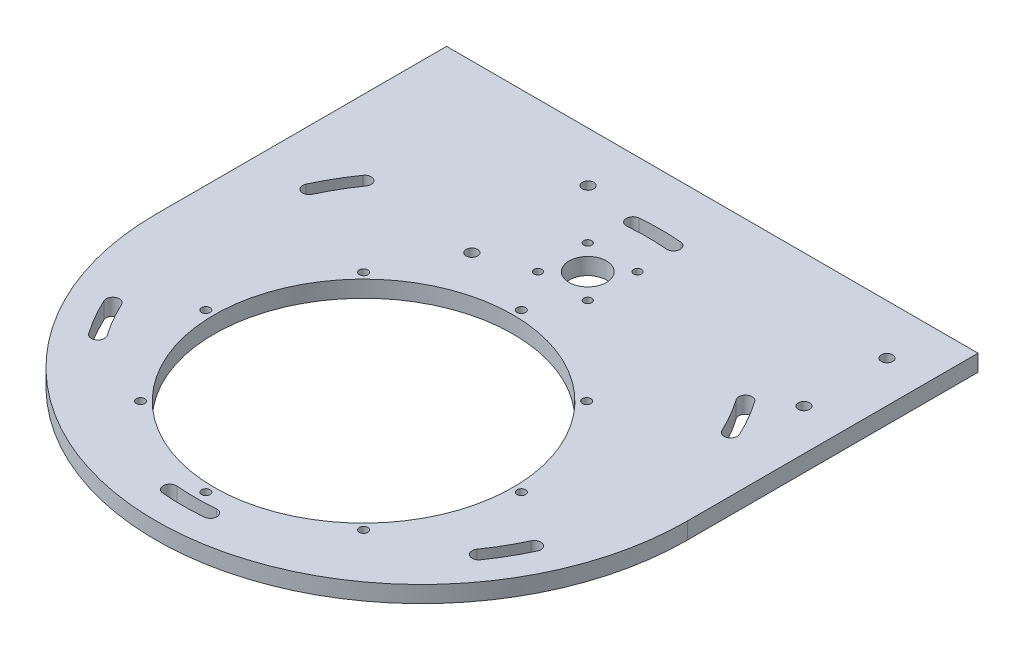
ISO-10303-21;
HEADER;
FILE_DESCRIPTION(('STEP AP214'),'2;1');
FILE_NAME('part.step','',(''),(''),'','','');
FILE_SCHEMA(('AUTOMOTIVE_DESIGN { 1 0 10303 214 1 1 1 1 }'));
ENDSEC;
DATA;
#1=APPLICATION_CONTEXT('core data for automotive mechanical design processes');
#2=APPLICATION_PROTOCOL_DEFINITION('international standard','automotive_design',2000,#1);
#3=PRODUCT_CONTEXT('',#1,'mechanical');
#4=PRODUCT('Part','Part','',(#3));
#5=PRODUCT_RELATED_PRODUCT_CATEGORY('part','',(#4));
#6=PRODUCT_DEFINITION_FORMATION('','',#4);
#7=PRODUCT_DEFINITION_CONTEXT('part definition',#1,'design');
#8=PRODUCT_DEFINITION('design','',#6,#7);
#9=PRODUCT_DEFINITION_SHAPE('','',#8);
#10=(LENGTH_UNIT() NAMED_UNIT(*) SI_UNIT(.MILLI.,.METRE.));
#11=(NAMED_UNIT(*) PLANE_ANGLE_UNIT() SI_UNIT($,.RADIAN.));
#12=(NAMED_UNIT(*) SI_UNIT($,.STERADIAN.) SOLID_ANGLE_UNIT());
#13=UNCERTAINTY_MEASURE_WITH_UNIT(LENGTH_MEASURE(1.E-05),#10,'distance_accuracy_value','');
#14=(GEOMETRIC_REPRESENTATION_CONTEXT(3) GLOBAL_UNCERTAINTY_ASSIGNED_CONTEXT((#13)) GLOBAL_UNIT_ASSIGNED_CONTEXT((#10,
#11,#12)) REPRESENTATION_CONTEXT('',''));
#15=CARTESIAN_POINT('',(0.,0.,0.));
#16=DIRECTION('',(0.,0.,1.));
#17=DIRECTION('',(1.,0.,0.));
#18=AXIS2_PLACEMENT_3D('',#15,#16,#17);
#19=CARTESIAN_POINT('',(-101.6,-6.35,-133.35));
#20=DIRECTION('',(-1.,0.,0.));
#21=DIRECTION('',(0.,0.,1.));
#22=AXIS2_PLACEMENT_3D('',#19,#20,#21);
#23=PLANE('',#22);
#24=DIRECTION('',(0.,0.,1.));
#25=VECTOR('',#24,1.);
#26=CARTESIAN_POINT('',(-101.6,0.,-133.35));
#27=LINE('',#26,#25);
#28=CARTESIAN_POINT('',(-101.6,0.,-133.35));
#29=VERTEX_POINT('',#28);
#30=CARTESIAN_POINT('',(-101.6,0.,-22.225));
#31=VERTEX_POINT('',#30);
#32=EDGE_CURVE('E468',#29,#31,#27,.T.);
#33=ORIENTED_EDGE('',*,*,#32,.F.);
#34=DIRECTION('',(0.,1.,0.));
#35=VECTOR('',#34,1.);
#36=CARTESIAN_POINT('',(-101.6,-6.35,-133.35));
#37=LINE('',#36,#35);
#38=CARTESIAN_POINT('',(-101.6,-6.35,-133.35));
#39=VERTEX_POINT('',#38);
#40=EDGE_CURVE('E11',#39,#29,#37,.T.);
#41=ORIENTED_EDGE('',*,*,#40,.F.);
#42=DIRECTION('',(0.,0.,1.));
#43=VECTOR('',#42,1.);
#44=CARTESIAN_POINT('',(-101.6,-6.35,-133.35));
#45=LINE('',#44,#43);
#46=CARTESIAN_POINT('',(-101.6,-6.35,-22.225));
#47=VERTEX_POINT('',#46);
#48=EDGE_CURVE('E471',#39,#47,#45,.T.);
#49=ORIENTED_EDGE('',*,*,#48,.T.);
#50=DIRECTION('',(0.,1.,0.));
#51=VECTOR('',#50,1.);
#52=CARTESIAN_POINT('',(-101.6,-6.35,-22.225));
#53=LINE('',#52,#51);
#54=EDGE_CURVE('E484',#47,#31,#53,.T.);
#55=ORIENTED_EDGE('',*,*,#54,.T.);
#56=EDGE_LOOP('',(#33,#41,#49,#55));
#57=FACE_BOUND('',#56,.T.);
#58=ADVANCED_FACE('F34',(#57),#23,.T.);
#59=CARTESIAN_POINT('',(-101.6,-6.35,-133.35));
#60=DIRECTION('',(0.,0.,-1.));
#61=DIRECTION('',(-1.,0.,0.));
#62=AXIS2_PLACEMENT_3D('',#59,#60,#61);
#63=PLANE('',#62);
#64=DIRECTION('',(-1.,0.,0.));
#65=VECTOR('',#64,1.);
#66=CARTESIAN_POINT('',(-101.6,0.,-133.35));
#67=LINE('',#66,#65);
#68=CARTESIAN_POINT('',(101.6,0.,-133.35));
#69=VERTEX_POINT('',#68);
#70=EDGE_CURVE('E475',#69,#29,#67,.T.);
#71=ORIENTED_EDGE('',*,*,#70,.F.);
#72=DIRECTION('',(0.,1.,0.));
#73=VECTOR('',#72,1.);
#74=CARTESIAN_POINT('',(101.6,-6.35,-133.35));
#75=LINE('',#74,#73);
#76=CARTESIAN_POINT('',(101.6,-6.35,-133.35));
#77=VERTEX_POINT('',#76);
#78=EDGE_CURVE('E42',#77,#69,#75,.T.);
#79=ORIENTED_EDGE('',*,*,#78,.F.);
#80=DIRECTION('',(-1.,0.,0.));
#81=VECTOR('',#80,1.);
#82=CARTESIAN_POINT('',(-101.6,-6.35,-133.35));
#83=LINE('',#82,#81);
#84=EDGE_CURVE('E481',#77,#39,#83,.T.);
#85=ORIENTED_EDGE('',*,*,#84,.T.);
#86=ORIENTED_EDGE('',*,*,#40,.T.);
#87=EDGE_LOOP('',(#71,#79,#85,#86));
#88=FACE_BOUND('',#87,.T.);
#89=ADVANCED_FACE('F524',(#88),#63,.T.);
#90=CARTESIAN_POINT('',(101.6,-6.35,-133.35));
#91=DIRECTION('',(1.,0.,0.));
#92=DIRECTION('',(0.,0.,-1.));
#93=AXIS2_PLACEMENT_3D('',#90,#91,#92);
#94=PLANE('',#93);
#95=DIRECTION('',(0.,0.,-1.));
#96=VECTOR('',#95,1.);
#97=CARTESIAN_POINT('',(101.6,0.,-133.35));
#98=LINE('',#97,#96);
#99=CARTESIAN_POINT('',(101.6,0.,-22.225));
#100=VERTEX_POINT('',#99);
#101=EDGE_CURVE('E490',#100,#69,#98,.T.);
#102=ORIENTED_EDGE('',*,*,#101,.F.);
#103=DIRECTION('',(0.,1.,0.));
#104=VECTOR('',#103,1.);
#105=CARTESIAN_POINT('',(101.6,-6.35,-22.225));
#106=LINE('',#105,#104);
#107=CARTESIAN_POINT('',(101.6,-6.35,-22.225));
#108=VERTEX_POINT('',#107);
#109=EDGE_CURVE('E496',#108,#100,#106,.T.);
#110=ORIENTED_EDGE('',*,*,#109,.F.);
#111=DIRECTION('',(0.,0.,-1.));
#112=VECTOR('',#111,1.);
#113=CARTESIAN_POINT('',(101.6,-6.35,-133.35));
#114=LINE('',#113,#112);
#115=EDGE_CURVE('E478',#108,#77,#114,.T.);
#116=ORIENTED_EDGE('',*,*,#115,.T.);
#117=ORIENTED_EDGE('',*,*,#78,.T.);
#118=EDGE_LOOP('',(#102,#110,#116,#117));
#119=FACE_BOUND('',#118,.T.);
#120=ADVANCED_FACE('F529',(#119),#94,.T.);
#121=CARTESIAN_POINT('',(0.,-6.35,-22.225));
#122=DIRECTION('',(0.,1.,0.));
#123=DIRECTION('',(0.,0.,1.));
#124=AXIS2_PLACEMENT_3D('',#121,#122,#123);
#125=CYLINDRICAL_SURFACE('',#124,101.6);
#126=CARTESIAN_POINT('',(0.,0.,-22.225));
#127=DIRECTION('',(0.,1.,0.));
#128=DIRECTION('',(0.,0.,1.));
#129=AXIS2_PLACEMENT_3D('',#126,#127,#128);
#130=CIRCLE('',#129,101.6);
#131=EDGE_CURVE('E487',#31,#100,#130,.T.);
#132=ORIENTED_EDGE('',*,*,#131,.F.);
#133=ORIENTED_EDGE('',*,*,#54,.F.);
#134=CARTESIAN_POINT('',(0.,-6.35,-22.225));
#135=DIRECTION('',(0.,1.,0.));
#136=DIRECTION('',(0.,0.,1.));
#137=AXIS2_PLACEMENT_3D('',#134,#135,#136);
#138=CIRCLE('',#137,101.6);
#139=EDGE_CURVE('E474',#47,#108,#138,.T.);
#140=ORIENTED_EDGE('',*,*,#139,.T.);
#141=ORIENTED_EDGE('',*,*,#109,.T.);
#142=EDGE_LOOP('',(#132,#133,#140,#141));
#143=FACE_BOUND('',#142,.T.);
#144=ADVANCED_FACE('F544',(#143),#125,.T.);
#145=CARTESIAN_POINT('',(0.,-6.35,-22.225));
#146=DIRECTION('',(0.,1.,0.));
#147=DIRECTION('',(0.,0.,1.));
#148=AXIS2_PLACEMENT_3D('',#145,#146,#147);
#149=PLANE('',#148);
#150=CARTESIAN_POINT('',(-42.6562165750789,-6.35,42.6562165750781));
#151=DIRECTION('',(0.,1.,0.));
#152=DIRECTION('',(0.,0.,1.));
#153=AXIS2_PLACEMENT_3D('',#150,#151,#152);
#154=CIRCLE('',#153,1.63194999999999);
#155=CARTESIAN_POINT('',(-42.6562165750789,-6.35,44.2881665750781));
#156=VERTEX_POINT('',#155);
#157=EDGE_CURVE('E970',#156,#156,#154,.T.);
#158=ORIENTED_EDGE('',*,*,#157,.T.);
#159=EDGE_LOOP('',(#158));
#160=FACE_BOUND('',#159,.T.);
#161=CARTESIAN_POINT('',(-4.20815733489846E-13,-6.35,60.325));
#162=DIRECTION('',(0.,1.,0.));
#163=DIRECTION('',(0.,0.,1.));
#164=AXIS2_PLACEMENT_3D('',#161,#162,#163);
#165=CIRCLE('',#164,1.63194999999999);
#166=CARTESIAN_POINT('',(-4.20815733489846E-13,-6.35,61.95695));
#167=VERTEX_POINT('',#166);
#168=EDGE_CURVE('E974',#167,#167,#165,.T.);
#169=ORIENTED_EDGE('',*,*,#168,.T.);
#170=EDGE_LOOP('',(#169));
#171=FACE_BOUND('',#170,.T.);
#172=CARTESIAN_POINT('',(42.6562165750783,-6.35,42.6562165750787));
#173=DIRECTION('',(0.,1.,0.));
#174=DIRECTION('',(0.,0.,1.));
#175=AXIS2_PLACEMENT_3D('',#172,#173,#174);
#176=CIRCLE('',#175,1.63194999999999);
#177=CARTESIAN_POINT('',(42.6562165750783,-6.35,44.2881665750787));
#178=VERTEX_POINT('',#177);
#179=EDGE_CURVE('E984',#178,#178,#176,.T.);
#180=ORIENTED_EDGE('',*,*,#179,.T.);
#181=EDGE_LOOP('',(#180));
#182=FACE_BOUND('',#181,.T.);
#183=CARTESIAN_POINT('',(9.5250000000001,-6.35,-76.1999999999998));
#184=DIRECTION('',(0.,1.,0.));
#185=DIRECTION('',(0.,0.,1.));
#186=AXIS2_PLACEMENT_3D('',#183,#184,#185);
#187=CIRCLE('',#186,1.524);
#188=CARTESIAN_POINT('',(9.5250000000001,-6.35,-74.6759999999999));
#189=VERTEX_POINT('',#188);
#190=EDGE_CURVE('E992',#189,#189,#187,.T.);
#191=ORIENTED_EDGE('',*,*,#190,.T.);
#192=EDGE_LOOP('',(#191));
#193=FACE_BOUND('',#192,.T.);
#194=CARTESIAN_POINT('',(-9.52499999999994,-6.35,-76.1999999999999));
#195=DIRECTION('',(0.,1.,0.));
#196=DIRECTION('',(0.,0.,1.));
#197=AXIS2_PLACEMENT_3D('',#194,#195,#196);
#198=CIRCLE('',#197,1.524);
#199=CARTESIAN_POINT('',(-9.52499999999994,-6.35,-74.6759999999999));
#200=VERTEX_POINT('',#199);
#201=EDGE_CURVE('E998',#200,#200,#198,.T.);
#202=ORIENTED_EDGE('',*,*,#201,.T.);
#203=EDGE_LOOP('',(#202));
#204=FACE_BOUND('',#203,.T.);
#205=CARTESIAN_POINT('',(9.5250000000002,-6.35,-95.2499999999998));
#206=DIRECTION('',(0.,1.,0.));
#207=DIRECTION('',(0.,0.,1.));
#208=AXIS2_PLACEMENT_3D('',#205,#206,#207);
#209=CIRCLE('',#208,1.524);
#210=CARTESIAN_POINT('',(9.5250000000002,-6.35,-93.7259999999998));
#211=VERTEX_POINT('',#210);
#212=EDGE_CURVE('E1004',#211,#211,#209,.T.);
#213=ORIENTED_EDGE('',*,*,#212,.T.);
#214=EDGE_LOOP('',(#213));
#215=FACE_BOUND('',#214,.T.);
#216=CARTESIAN_POINT('',(-9.52499999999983,-6.35,-95.2499999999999));
#217=DIRECTION('',(0.,1.,0.));
#218=DIRECTION('',(0.,0.,1.));
#219=AXIS2_PLACEMENT_3D('',#216,#217,#218);
#220=CIRCLE('',#219,1.524);
#221=CARTESIAN_POINT('',(-9.52499999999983,-6.35,-93.7259999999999));
#222=VERTEX_POINT('',#221);
#223=EDGE_CURVE('E37',#222,#222,#220,.T.);
#224=ORIENTED_EDGE('',*,*,#223,.T.);
#225=EDGE_LOOP('',(#224));
#226=FACE_BOUND('',#225,.T.);
#227=CARTESIAN_POINT('',(0.,-6.35,-22.225));
#228=DIRECTION('',(0.,1.,0.));
#229=DIRECTION('',(0.,0.,1.));
#230=AXIS2_PLACEMENT_3D('',#227,#228,#229);
#231=CIRCLE('',#230,86.36);
#232=CARTESIAN_POINT('',(78.2687404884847,-6.35,-58.7223130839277));
#233=VERTEX_POINT('',#232);
#234=CARTESIAN_POINT('',(70.7419705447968,-6.35,-71.7590610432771));
#235=VERTEX_POINT('',#234);
#236=EDGE_CURVE('E239',#233,#235,#231,.T.);
#237=ORIENTED_EDGE('',*,*,#236,.F.);
#238=CARTESIAN_POINT('',(80.5707622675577,-6.35,-59.7957634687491));
#239=DIRECTION('',(0.,1.,0.));
#240=DIRECTION('',(0.,0.,1.));
#241=AXIS2_PLACEMENT_3D('',#238,#239,#240);
#242=CIRCLE('',#241,2.54);
#243=CARTESIAN_POINT('',(82.8727840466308,-6.35,-60.8692138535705));
#244=VERTEX_POINT('',#243);
#245=EDGE_CURVE('E221',#244,#233,#242,.F.);
#246=ORIENTED_EDGE('',*,*,#245,.F.);
#247=CARTESIAN_POINT('',(0.,-6.35,-22.225));
#248=DIRECTION('',(0.,1.,0.));
#249=DIRECTION('',(0.,0.,1.));
#250=AXIS2_PLACEMENT_3D('',#247,#248,#249);
#251=CIRCLE('',#250,91.44);
#252=CARTESIAN_POINT('',(74.9032629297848,-6.35,-74.6728293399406));
#253=VERTEX_POINT('',#252);
#254=EDGE_CURVE('E230',#253,#244,#251,.F.);
#255=ORIENTED_EDGE('',*,*,#254,.F.);
#256=CARTESIAN_POINT('',(72.8226167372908,-6.35,-73.2159451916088));
#257=DIRECTION('',(0.,1.,0.));
#258=DIRECTION('',(0.,0.,1.));
#259=AXIS2_PLACEMENT_3D('',#256,#257,#258);
#260=CIRCLE('',#259,2.54000000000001);
#261=EDGE_CURVE('E50',#235,#253,#260,.F.);
#262=ORIENTED_EDGE('',*,*,#261,.F.);
#263=EDGE_LOOP('',(#237,#246,#255,#262));
#264=FACE_BOUND('',#263,.T.);
#265=CARTESIAN_POINT('',(0.,-6.35,-22.225));
#266=DIRECTION('',(0.,1.,0.));
#267=DIRECTION('',(0.,0.,1.));
#268=AXIS2_PLACEMENT_3D('',#265,#266,#267);
#269=CIRCLE('',#268,86.36);
#270=CARTESIAN_POINT('',(70.7419705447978,-6.35,27.3090610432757));
#271=VERTEX_POINT('',#270);
#272=CARTESIAN_POINT('',(78.2687404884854,-6.35,14.2723130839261));
#273=VERTEX_POINT('',#272);
#274=EDGE_CURVE('E257',#271,#273,#269,.T.);
#275=ORIENTED_EDGE('',*,*,#274,.F.);
#276=CARTESIAN_POINT('',(72.8226167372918,-6.35,28.7659451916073));
#277=DIRECTION('',(0.,1.,0.));
#278=DIRECTION('',(0.,0.,1.));
#279=AXIS2_PLACEMENT_3D('',#276,#277,#278);
#280=CIRCLE('',#279,2.54);
#281=CARTESIAN_POINT('',(74.9032629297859,-6.35,30.222829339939));
#282=VERTEX_POINT('',#281);
#283=EDGE_CURVE('E260',#282,#271,#280,.F.);
#284=ORIENTED_EDGE('',*,*,#283,.F.);
#285=CARTESIAN_POINT('',(0.,-6.35,-22.225));
#286=DIRECTION('',(0.,1.,0.));
#287=DIRECTION('',(0.,0.,1.));
#288=AXIS2_PLACEMENT_3D('',#285,#286,#287);
#289=CIRCLE('',#288,91.44);
#290=CARTESIAN_POINT('',(82.8727840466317,-6.35,16.4192138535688));
#291=VERTEX_POINT('',#290);
#292=EDGE_CURVE('E277',#291,#282,#289,.F.);
#293=ORIENTED_EDGE('',*,*,#292,.F.);
#294=CARTESIAN_POINT('',(80.5707622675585,-6.35,15.3457634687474));
#295=DIRECTION('',(0.,1.,0.));
#296=DIRECTION('',(0.,0.,1.));
#297=AXIS2_PLACEMENT_3D('',#294,#295,#296);
#298=CIRCLE('',#297,2.54000000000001);
#299=EDGE_CURVE('E233',#273,#291,#298,.F.);
#300=ORIENTED_EDGE('',*,*,#299,.F.);
#301=EDGE_LOOP('',(#275,#284,#293,#300));
#302=FACE_BOUND('',#301,.T.);
#303=CARTESIAN_POINT('',(0.,-6.35,-22.225));
#304=DIRECTION('',(0.,1.,0.));
#305=DIRECTION('',(0.,0.,1.));
#306=AXIS2_PLACEMENT_3D('',#303,#304,#305);
#307=CIRCLE('',#306,86.36);
#308=CARTESIAN_POINT('',(-7.52676994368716,-6.35,63.8063741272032));
#309=VERTEX_POINT('',#308);
#310=CARTESIAN_POINT('',(7.52676994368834,-6.35,63.8063741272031));
#311=VERTEX_POINT('',#310);
#312=EDGE_CURVE('E288',#309,#311,#307,.T.);
#313=ORIENTED_EDGE('',*,*,#312,.F.);
#314=CARTESIAN_POINT('',(-7.74814553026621,-6.35,66.3367086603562));
#315=DIRECTION('',(0.,1.,0.));
#316=DIRECTION('',(0.,0.,1.));
#317=AXIS2_PLACEMENT_3D('',#314,#315,#316);
#318=CIRCLE('',#317,2.54);
#319=CARTESIAN_POINT('',(-7.96952111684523,-6.35,68.8670431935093));
#320=VERTEX_POINT('',#319);
#321=EDGE_CURVE('E291',#320,#309,#318,.F.);
#322=ORIENTED_EDGE('',*,*,#321,.F.);
#323=CARTESIAN_POINT('',(0.,-6.35,-22.225));
#324=DIRECTION('',(0.,1.,0.));
#325=DIRECTION('',(0.,0.,1.));
#326=AXIS2_PLACEMENT_3D('',#323,#324,#325);
#327=CIRCLE('',#326,91.44);
#328=CARTESIAN_POINT('',(7.96952111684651,-6.35,68.8670431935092));
#329=VERTEX_POINT('',#328);
#330=EDGE_CURVE('E308',#329,#320,#327,.F.);
#331=ORIENTED_EDGE('',*,*,#330,.F.);
#332=CARTESIAN_POINT('',(7.74814553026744,-6.35,66.3367086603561));
#333=DIRECTION('',(0.,1.,0.));
#334=DIRECTION('',(0.,0.,1.));
#335=AXIS2_PLACEMENT_3D('',#332,#333,#334);
#336=CIRCLE('',#335,2.54000000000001);
#337=EDGE_CURVE('E286',#311,#329,#336,.F.);
#338=ORIENTED_EDGE('',*,*,#337,.F.);
#339=EDGE_LOOP('',(#313,#322,#331,#338));
#340=FACE_BOUND('',#339,.T.);
#341=CARTESIAN_POINT('',(0.,-6.35,-22.225));
#342=DIRECTION('',(0.,1.,0.));
#343=DIRECTION('',(0.,0.,1.));
#344=AXIS2_PLACEMENT_3D('',#341,#342,#343);
#345=CIRCLE('',#344,86.36);
#346=CARTESIAN_POINT('',(-78.2687404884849,-6.35,14.2723130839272));
#347=VERTEX_POINT('',#346);
#348=CARTESIAN_POINT('',(-70.7419705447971,-6.35,27.3090610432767));
#349=VERTEX_POINT('',#348);
#350=EDGE_CURVE('E319',#347,#349,#345,.T.);
#351=ORIENTED_EDGE('',*,*,#350,.F.);
#352=CARTESIAN_POINT('',(-80.570762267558,-6.35,15.3457634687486));
#353=DIRECTION('',(0.,1.,0.));
#354=DIRECTION('',(0.,0.,1.));
#355=AXIS2_PLACEMENT_3D('',#352,#353,#354);
#356=CIRCLE('',#355,2.54);
#357=CARTESIAN_POINT('',(-82.8727840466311,-6.35,16.4192138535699));
#358=VERTEX_POINT('',#357);
#359=EDGE_CURVE('E322',#358,#347,#356,.F.);
#360=ORIENTED_EDGE('',*,*,#359,.F.);
#361=CARTESIAN_POINT('',(0.,-6.35,-22.225));
#362=DIRECTION('',(0.,1.,0.));
#363=DIRECTION('',(0.,0.,1.));
#364=AXIS2_PLACEMENT_3D('',#361,#362,#363);
#365=CIRCLE('',#364,91.44);
#366=CARTESIAN_POINT('',(-74.9032629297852,-6.35,30.22282933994));
#367=VERTEX_POINT('',#366);
#368=EDGE_CURVE('E339',#367,#358,#365,.F.);
#369=ORIENTED_EDGE('',*,*,#368,.F.);
#370=CARTESIAN_POINT('',(-72.8226167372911,-6.35,28.7659451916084));
#371=DIRECTION('',(0.,1.,0.));
#372=DIRECTION('',(0.,0.,1.));
#373=AXIS2_PLACEMENT_3D('',#370,#371,#372);
#374=CIRCLE('',#373,2.54000000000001);
#375=EDGE_CURVE('E317',#349,#367,#374,.F.);
#376=ORIENTED_EDGE('',*,*,#375,.F.);
#377=EDGE_LOOP('',(#351,#360,#369,#376));
#378=FACE_BOUND('',#377,.T.);
#379=CARTESIAN_POINT('',(0.,-6.35,-22.225));
#380=DIRECTION('',(0.,1.,0.));
#381=DIRECTION('',(0.,0.,1.));
#382=AXIS2_PLACEMENT_3D('',#379,#380,#381);
#383=CIRCLE('',#382,86.36);
#384=CARTESIAN_POINT('',(-70.7419705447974,-6.35,-71.7590610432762));
#385=VERTEX_POINT('',#384);
#386=CARTESIAN_POINT('',(-78.2687404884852,-6.35,-58.7223130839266));
#387=VERTEX_POINT('',#386);
#388=EDGE_CURVE('E350',#385,#387,#383,.T.);
#389=ORIENTED_EDGE('',*,*,#388,.F.);
#390=CARTESIAN_POINT('',(-72.8226167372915,-6.35,-73.2159451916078));
#391=DIRECTION('',(0.,1.,0.));
#392=DIRECTION('',(0.,0.,1.));
#393=AXIS2_PLACEMENT_3D('',#390,#391,#392);
#394=CIRCLE('',#393,2.54);
#395=CARTESIAN_POINT('',(-74.9032629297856,-6.35,-74.6728293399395));
#396=VERTEX_POINT('',#395);
#397=EDGE_CURVE('E353',#396,#385,#394,.F.);
#398=ORIENTED_EDGE('',*,*,#397,.F.);
#399=CARTESIAN_POINT('',(0.,-6.35,-22.225));
#400=DIRECTION('',(0.,1.,0.));
#401=DIRECTION('',(0.,0.,1.));
#402=AXIS2_PLACEMENT_3D('',#399,#400,#401);
#403=CIRCLE('',#402,91.44);
#404=CARTESIAN_POINT('',(-82.8727840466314,-6.35,-60.8692138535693));
#405=VERTEX_POINT('',#404);
#406=EDGE_CURVE('E370',#405,#396,#403,.F.);
#407=ORIENTED_EDGE('',*,*,#406,.F.);
#408=CARTESIAN_POINT('',(-80.5707622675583,-6.35,-59.795763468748));
#409=DIRECTION('',(0.,1.,0.));
#410=DIRECTION('',(0.,0.,1.));
#411=AXIS2_PLACEMENT_3D('',#408,#409,#410);
#412=CIRCLE('',#411,2.54000000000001);
#413=EDGE_CURVE('E348',#387,#405,#412,.F.);
#414=ORIENTED_EDGE('',*,*,#413,.F.);
#415=EDGE_LOOP('',(#389,#398,#407,#414));
#416=FACE_BOUND('',#415,.T.);
#417=CARTESIAN_POINT('',(0.,-6.35,-22.225));
#418=DIRECTION('',(0.,1.,0.));
#419=DIRECTION('',(0.,0.,1.));
#420=AXIS2_PLACEMENT_3D('',#417,#418,#419);
#421=CIRCLE('',#420,86.36);
#422=CARTESIAN_POINT('',(7.52676994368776,-6.35,-108.256374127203));
#423=VERTEX_POINT('',#422);
#424=CARTESIAN_POINT('',(-7.52676994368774,-6.35,-108.256374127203));
#425=VERTEX_POINT('',#424);
#426=EDGE_CURVE('E381',#423,#425,#421,.T.);
#427=ORIENTED_EDGE('',*,*,#426,.F.);
#428=CARTESIAN_POINT('',(7.74814553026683,-6.35,-110.786708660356));
#429=DIRECTION('',(0.,1.,0.));
#430=DIRECTION('',(0.,0.,1.));
#431=AXIS2_PLACEMENT_3D('',#428,#429,#430);
#432=CIRCLE('',#431,2.54);
#433=CARTESIAN_POINT('',(7.96952111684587,-6.35,-113.317043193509));
#434=VERTEX_POINT('',#433);
#435=EDGE_CURVE('E384',#434,#423,#432,.F.);
#436=ORIENTED_EDGE('',*,*,#435,.F.);
#437=CARTESIAN_POINT('',(0.,-6.35,-22.225));
#438=DIRECTION('',(0.,1.,0.));
#439=DIRECTION('',(0.,0.,1.));
#440=AXIS2_PLACEMENT_3D('',#437,#438,#439);
#441=CIRCLE('',#440,91.44);
#442=CARTESIAN_POINT('',(-7.96952111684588,-6.35,-113.317043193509));
#443=VERTEX_POINT('',#442);
#444=EDGE_CURVE('E401',#443,#434,#441,.F.);
#445=ORIENTED_EDGE('',*,*,#444,.F.);
#446=CARTESIAN_POINT('',(-7.74814553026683,-6.35,-110.786708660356));
#447=DIRECTION('',(0.,1.,0.));
#448=DIRECTION('',(0.,0.,1.));
#449=AXIS2_PLACEMENT_3D('',#446,#447,#448);
#450=CIRCLE('',#449,2.54000000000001);
#451=EDGE_CURVE('E379',#425,#443,#450,.F.);
#452=ORIENTED_EDGE('',*,*,#451,.F.);
#453=EDGE_LOOP('',(#427,#436,#445,#452));
#454=FACE_BOUND('',#453,.T.);
#455=CARTESIAN_POINT('',(85.852,-6.35,-114.3));
#456=DIRECTION('',(0.,1.,0.));
#457=DIRECTION('',(0.,0.,1.));
#458=AXIS2_PLACEMENT_3D('',#455,#456,#457);
#459=CIRCLE('',#458,2.19709999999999);
#460=CARTESIAN_POINT('',(85.852,-6.35,-112.1029));
#461=VERTEX_POINT('',#460);
#462=EDGE_CURVE('E413',#461,#461,#459,.T.);
#463=ORIENTED_EDGE('',*,*,#462,.T.);
#464=EDGE_LOOP('',(#463));
#465=FACE_BOUND('',#464,.T.);
#466=CARTESIAN_POINT('',(85.852,-6.35,-82.5499999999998));
#467=DIRECTION('',(0.,1.,0.));
#468=DIRECTION('',(0.,0.,1.));
#469=AXIS2_PLACEMENT_3D('',#466,#467,#468);
#470=CIRCLE('',#469,2.19709999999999);
#471=CARTESIAN_POINT('',(85.852,-6.35,-80.3528999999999));
#472=VERTEX_POINT('',#471);
#473=EDGE_CURVE('E417',#472,#472,#470,.T.);
#474=ORIENTED_EDGE('',*,*,#473,.T.);
#475=EDGE_LOOP('',(#474));
#476=FACE_BOUND('',#475,.T.);
#477=CARTESIAN_POINT('',(-28.448,-6.35,-69.8499999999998));
#478=DIRECTION('',(0.,1.,0.));
#479=DIRECTION('',(0.,0.,1.));
#480=AXIS2_PLACEMENT_3D('',#477,#478,#479);
#481=CIRCLE('',#480,2.19709999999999);
#482=CARTESIAN_POINT('',(-28.448,-6.35,-67.6528999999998));
#483=VERTEX_POINT('',#482);
#484=EDGE_CURVE('E423',#483,#483,#481,.T.);
#485=ORIENTED_EDGE('',*,*,#484,.T.);
#486=EDGE_LOOP('',(#485));
#487=FACE_BOUND('',#486,.T.);
#488=CARTESIAN_POINT('',(-28.448,-6.35,-114.3));
#489=DIRECTION('',(0.,1.,0.));
#490=DIRECTION('',(0.,0.,1.));
#491=AXIS2_PLACEMENT_3D('',#488,#489,#490);
#492=CIRCLE('',#491,2.19709999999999);
#493=CARTESIAN_POINT('',(-28.448,-6.35,-112.1029));
#494=VERTEX_POINT('',#493);
#495=EDGE_CURVE('E429',#494,#494,#492,.T.);
#496=ORIENTED_EDGE('',*,*,#495,.T.);
#497=EDGE_LOOP('',(#496));
#498=FACE_BOUND('',#497,.T.);
#499=CARTESIAN_POINT('',(-60.325,-6.35,-6.31439345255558E-13));
#500=DIRECTION('',(0.,1.,0.));
#501=DIRECTION('',(0.,0.,1.));
#502=AXIS2_PLACEMENT_3D('',#499,#500,#501);
#503=CIRCLE('',#502,1.63194999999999);
#504=CARTESIAN_POINT('',(-60.325,-6.35,1.63194999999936));
#505=VERTEX_POINT('',#504);
#506=EDGE_CURVE('E433',#505,#505,#503,.T.);
#507=ORIENTED_EDGE('',*,*,#506,.T.);
#508=EDGE_LOOP('',(#507));
#509=FACE_BOUND('',#508,.T.);
#510=CARTESIAN_POINT('',(-42.656216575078,-6.35,-42.656216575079));
#511=DIRECTION('',(0.,1.,0.));
#512=DIRECTION('',(0.,0.,1.));
#513=AXIS2_PLACEMENT_3D('',#510,#511,#512);
#514=CIRCLE('',#513,1.63194999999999);
#515=CARTESIAN_POINT('',(-42.656216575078,-6.35,-41.024266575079));
#516=VERTEX_POINT('',#515);
#517=EDGE_CURVE('E439',#516,#516,#514,.T.);
#518=ORIENTED_EDGE('',*,*,#517,.T.);
#519=EDGE_LOOP('',(#518));
#520=FACE_BOUND('',#519,.T.);
#521=CARTESIAN_POINT('',(0.,-6.35,-60.325));
#522=DIRECTION('',(0.,1.,0.));
#523=DIRECTION('',(0.,0.,1.));
#524=AXIS2_PLACEMENT_3D('',#521,#522,#523);
#525=CIRCLE('',#524,1.63194999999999);
#526=CARTESIAN_POINT('',(0.,-6.35,-58.69305));
#527=VERTEX_POINT('',#526);
#528=EDGE_CURVE('E443',#527,#527,#525,.T.);
#529=ORIENTED_EDGE('',*,*,#528,.T.);
#530=EDGE_LOOP('',(#529));
#531=FACE_BOUND('',#530,.T.);
#532=CARTESIAN_POINT('',(42.6562165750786,-6.35,-42.6562165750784));
#533=DIRECTION('',(0.,1.,0.));
#534=DIRECTION('',(0.,0.,1.));
#535=AXIS2_PLACEMENT_3D('',#532,#533,#534);
#536=CIRCLE('',#535,1.63194999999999);
#537=CARTESIAN_POINT('',(42.6562165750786,-6.35,-41.0242665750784));
#538=VERTEX_POINT('',#537);
#539=EDGE_CURVE('E449',#538,#538,#536,.T.);
#540=ORIENTED_EDGE('',*,*,#539,.T.);
#541=EDGE_LOOP('',(#540));
#542=FACE_BOUND('',#541,.T.);
#543=CARTESIAN_POINT('',(60.325,-6.35,2.1163626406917E-13));
#544=DIRECTION('',(0.,1.,0.));
#545=DIRECTION('',(0.,0.,1.));
#546=AXIS2_PLACEMENT_3D('',#543,#544,#545);
#547=CIRCLE('',#546,1.63194999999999);
#548=CARTESIAN_POINT('',(60.325,-6.35,1.6319500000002));
#549=VERTEX_POINT('',#548);
#550=EDGE_CURVE('E455',#549,#549,#547,.T.);
#551=ORIENTED_EDGE('',*,*,#550,.T.);
#552=EDGE_LOOP('',(#551));
#553=FACE_BOUND('',#552,.T.);
#554=CARTESIAN_POINT('',(0.,-6.35,-85.725));
#555=DIRECTION('',(0.,1.,0.));
#556=DIRECTION('',(0.,0.,1.));
#557=AXIS2_PLACEMENT_3D('',#554,#555,#556);
#558=CIRCLE('',#557,7.14375);
#559=CARTESIAN_POINT('',(0.,-6.35,-78.58125));
#560=VERTEX_POINT('',#559);
#561=EDGE_CURVE('E459',#560,#560,#558,.T.);
#562=ORIENTED_EDGE('',*,*,#561,.T.);
#563=EDGE_LOOP('',(#562));
#564=FACE_BOUND('',#563,.T.);
#565=CARTESIAN_POINT('',(0.,-6.35,0.));
#566=DIRECTION('',(0.,1.,0.));
#567=DIRECTION('',(0.,0.,1.));
#568=AXIS2_PLACEMENT_3D('',#565,#566,#567);
#569=CIRCLE('',#568,57.15);
#570=CARTESIAN_POINT('',(0.,-6.35,57.15));
#571=VERTEX_POINT('',#570);
#572=EDGE_CURVE('E465',#571,#571,#569,.T.);
#573=ORIENTED_EDGE('',*,*,#572,.T.);
#574=EDGE_LOOP('',(#573));
#575=FACE_BOUND('',#574,.T.);
#576=ORIENTED_EDGE('',*,*,#48,.F.);
#577=ORIENTED_EDGE('',*,*,#84,.F.);
#578=ORIENTED_EDGE('',*,*,#115,.F.);
#579=ORIENTED_EDGE('',*,*,#139,.F.);
#580=EDGE_LOOP('',(#576,#577,#578,#579));
#581=FACE_BOUND('',#580,.T.);
#582=ADVANCED_FACE('F236',(#160,#171,#182,#193,#204,#215,#226,#264,#302,#340,#378,#416,#454,
#465,#476,#487,#498,#509,#520,#531,#542,#553,#564,#575,#581),#149,.F.);
#583=CARTESIAN_POINT('',(0.,0.,-22.225));
#584=DIRECTION('',(0.,1.,0.));
#585=DIRECTION('',(0.,0.,1.));
#586=AXIS2_PLACEMENT_3D('',#583,#584,#585);
#587=PLANE('',#586);
#588=CARTESIAN_POINT('',(-42.6562165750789,0.,42.6562165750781));
#589=DIRECTION('',(0.,1.,0.));
#590=DIRECTION('',(0.,0.,1.));
#591=AXIS2_PLACEMENT_3D('',#588,#589,#590);
#592=CIRCLE('',#591,1.63194999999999);
#593=CARTESIAN_POINT('',(-42.6562165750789,0.,44.2881665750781));
#594=VERTEX_POINT('',#593);
#595=EDGE_CURVE('E973',#594,#594,#592,.T.);
#596=ORIENTED_EDGE('',*,*,#595,.F.);
#597=EDGE_LOOP('',(#596));
#598=FACE_BOUND('',#597,.T.);
#599=CARTESIAN_POINT('',(-4.20815733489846E-13,0.,60.325));
#600=DIRECTION('',(0.,1.,0.));
#601=DIRECTION('',(0.,0.,1.));
#602=AXIS2_PLACEMENT_3D('',#599,#600,#601);
#603=CIRCLE('',#602,1.63194999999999);
#604=CARTESIAN_POINT('',(-4.20815733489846E-13,0.,61.95695));
#605=VERTEX_POINT('',#604);
#606=EDGE_CURVE('E979',#605,#605,#603,.T.);
#607=ORIENTED_EDGE('',*,*,#606,.F.);
#608=EDGE_LOOP('',(#607));
#609=FACE_BOUND('',#608,.T.);
#610=CARTESIAN_POINT('',(42.6562165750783,0.,42.6562165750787));
#611=DIRECTION('',(0.,1.,0.));
#612=DIRECTION('',(0.,0.,1.));
#613=AXIS2_PLACEMENT_3D('',#610,#611,#612);
#614=CIRCLE('',#613,1.63194999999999);
#615=CARTESIAN_POINT('',(42.6562165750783,0.,44.2881665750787));
#616=VERTEX_POINT('',#615);
#617=EDGE_CURVE('E987',#616,#616,#614,.T.);
#618=ORIENTED_EDGE('',*,*,#617,.F.);
#619=EDGE_LOOP('',(#618));
#620=FACE_BOUND('',#619,.T.);
#621=CARTESIAN_POINT('',(9.5250000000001,0.,-76.1999999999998));
#622=DIRECTION('',(0.,1.,0.));
#623=DIRECTION('',(0.,0.,1.));
#624=AXIS2_PLACEMENT_3D('',#621,#622,#623);
#625=CIRCLE('',#624,1.524);
#626=CARTESIAN_POINT('',(9.5250000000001,0.,-74.6759999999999));
#627=VERTEX_POINT('',#626);
#628=EDGE_CURVE('E976',#627,#627,#625,.T.);
#629=ORIENTED_EDGE('',*,*,#628,.F.);
#630=EDGE_LOOP('',(#629));
#631=FACE_BOUND('',#630,.T.);
#632=CARTESIAN_POINT('',(-9.52499999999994,0.,-76.1999999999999));
#633=DIRECTION('',(0.,1.,0.));
#634=DIRECTION('',(0.,0.,1.));
#635=AXIS2_PLACEMENT_3D('',#632,#633,#634);
#636=CIRCLE('',#635,1.524);
#637=CARTESIAN_POINT('',(-9.52499999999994,0.,-74.6759999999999));
#638=VERTEX_POINT('',#637);
#639=EDGE_CURVE('E995',#638,#638,#636,.T.);
#640=ORIENTED_EDGE('',*,*,#639,.F.);
#641=EDGE_LOOP('',(#640));
#642=FACE_BOUND('',#641,.T.);
#643=CARTESIAN_POINT('',(9.5250000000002,0.,-95.2499999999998));
#644=DIRECTION('',(0.,1.,0.));
#645=DIRECTION('',(0.,0.,1.));
#646=AXIS2_PLACEMENT_3D('',#643,#644,#645);
#647=CIRCLE('',#646,1.524);
#648=CARTESIAN_POINT('',(9.5250000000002,0.,-93.7259999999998));
#649=VERTEX_POINT('',#648);
#650=EDGE_CURVE('E1001',#649,#649,#647,.T.);
#651=ORIENTED_EDGE('',*,*,#650,.F.);
#652=EDGE_LOOP('',(#651));
#653=FACE_BOUND('',#652,.T.);
#654=CARTESIAN_POINT('',(-9.52499999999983,0.,-95.2499999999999));
#655=DIRECTION('',(0.,1.,0.));
#656=DIRECTION('',(0.,0.,1.));
#657=AXIS2_PLACEMENT_3D('',#654,#655,#656);
#658=CIRCLE('',#657,1.524);
#659=CARTESIAN_POINT('',(-9.52499999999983,0.,-93.7259999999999));
#660=VERTEX_POINT('',#659);
#661=EDGE_CURVE('E1007',#660,#660,#658,.T.);
#662=ORIENTED_EDGE('',*,*,#661,.F.);
#663=EDGE_LOOP('',(#662));
#664=FACE_BOUND('',#663,.T.);
#665=CARTESIAN_POINT('',(80.5707622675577,0.,-59.7957634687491));
#666=DIRECTION('',(0.,1.,0.));
#667=DIRECTION('',(-0.866025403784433,0.,0.50000000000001));
#668=AXIS2_PLACEMENT_3D('',#665,#666,#667);
#669=CIRCLE('',#668,2.54);
#670=CARTESIAN_POINT('',(78.2687404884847,0.,-58.7223130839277));
#671=VERTEX_POINT('',#670);
#672=CARTESIAN_POINT('',(82.8727840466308,0.,-60.8692138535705));
#673=VERTEX_POINT('',#672);
#674=EDGE_CURVE('E58',#671,#673,#669,.T.);
#675=ORIENTED_EDGE('',*,*,#674,.F.);
#676=CARTESIAN_POINT('',(0.,0.,-22.225));
#677=DIRECTION('',(0.,-1.,0.));
#678=DIRECTION('',(-0.866025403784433,0.,0.50000000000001));
#679=AXIS2_PLACEMENT_3D('',#676,#677,#678);
#680=CIRCLE('',#679,86.36);
#681=CARTESIAN_POINT('',(70.7419705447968,0.,-71.7590610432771));
#682=VERTEX_POINT('',#681);
#683=EDGE_CURVE('E227',#682,#671,#680,.T.);
#684=ORIENTED_EDGE('',*,*,#683,.F.);
#685=CARTESIAN_POINT('',(72.8226167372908,0.,-73.2159451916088));
#686=DIRECTION('',(0.,1.,0.));
#687=DIRECTION('',(-0.866025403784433,0.,0.50000000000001));
#688=AXIS2_PLACEMENT_3D('',#685,#686,#687);
#689=CIRCLE('',#688,2.54000000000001);
#690=CARTESIAN_POINT('',(74.9032629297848,0.,-74.6728293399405));
#691=VERTEX_POINT('',#690);
#692=EDGE_CURVE('E247',#691,#682,#689,.T.);
#693=ORIENTED_EDGE('',*,*,#692,.F.);
#694=CARTESIAN_POINT('',(0.,0.,-22.225));
#695=DIRECTION('',(0.,1.,0.));
#696=DIRECTION('',(-0.866025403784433,0.,0.50000000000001));
#697=AXIS2_PLACEMENT_3D('',#694,#695,#696);
#698=CIRCLE('',#697,91.44);
#699=EDGE_CURVE('E241',#673,#691,#698,.T.);
#700=ORIENTED_EDGE('',*,*,#699,.F.);
#701=EDGE_LOOP('',(#675,#684,#693,#700));
#702=FACE_BOUND('',#701,.T.);
#703=CARTESIAN_POINT('',(72.8226167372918,0.,28.7659451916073));
#704=DIRECTION('',(0.,1.,0.));
#705=DIRECTION('',(-0.866025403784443,0.,-0.499999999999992));
#706=AXIS2_PLACEMENT_3D('',#703,#704,#705);
#707=CIRCLE('',#706,2.54);
#708=CARTESIAN_POINT('',(70.7419705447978,0.,27.3090610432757));
#709=VERTEX_POINT('',#708);
#710=CARTESIAN_POINT('',(74.9032629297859,0.,30.222829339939));
#711=VERTEX_POINT('',#710);
#712=EDGE_CURVE('E263',#709,#711,#707,.T.);
#713=ORIENTED_EDGE('',*,*,#712,.F.);
#714=CARTESIAN_POINT('',(0.,0.,-22.225));
#715=DIRECTION('',(0.,-1.,0.));
#716=DIRECTION('',(-0.866025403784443,0.,-0.499999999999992));
#717=AXIS2_PLACEMENT_3D('',#714,#715,#716);
#718=CIRCLE('',#717,86.36);
#719=CARTESIAN_POINT('',(78.2687404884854,0.,14.2723130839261));
#720=VERTEX_POINT('',#719);
#721=EDGE_CURVE('E271',#720,#709,#718,.T.);
#722=ORIENTED_EDGE('',*,*,#721,.F.);
#723=CARTESIAN_POINT('',(80.5707622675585,0.,15.3457634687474));
#724=DIRECTION('',(0.,1.,0.));
#725=DIRECTION('',(-0.866025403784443,0.,-0.499999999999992));
#726=AXIS2_PLACEMENT_3D('',#723,#724,#725);
#727=CIRCLE('',#726,2.54000000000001);
#728=CARTESIAN_POINT('',(82.8727840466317,0.,16.4192138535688));
#729=VERTEX_POINT('',#728);
#730=EDGE_CURVE('E268',#729,#720,#727,.T.);
#731=ORIENTED_EDGE('',*,*,#730,.F.);
#732=CARTESIAN_POINT('',(0.,0.,-22.225));
#733=DIRECTION('',(0.,1.,0.));
#734=DIRECTION('',(-0.866025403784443,0.,-0.499999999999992));
#735=AXIS2_PLACEMENT_3D('',#732,#733,#734);
#736=CIRCLE('',#735,91.44);
#737=EDGE_CURVE('E265',#711,#729,#736,.T.);
#738=ORIENTED_EDGE('',*,*,#737,.F.);
#739=EDGE_LOOP('',(#713,#722,#731,#738));
#740=FACE_BOUND('',#739,.T.);
#741=CARTESIAN_POINT('',(-7.74814553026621,0.,66.3367086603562));
#742=DIRECTION('',(0.,1.,0.));
#743=DIRECTION('',(0.,0.,-1.));
#744=AXIS2_PLACEMENT_3D('',#741,#742,#743);
#745=CIRCLE('',#744,2.54);
#746=CARTESIAN_POINT('',(-7.52676994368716,0.,63.8063741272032));
#747=VERTEX_POINT('',#746);
#748=CARTESIAN_POINT('',(-7.96952111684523,0.,68.8670431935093));
#749=VERTEX_POINT('',#748);
#750=EDGE_CURVE('E294',#747,#749,#745,.T.);
#751=ORIENTED_EDGE('',*,*,#750,.F.);
#752=CARTESIAN_POINT('',(0.,0.,-22.225));
#753=DIRECTION('',(0.,-1.,0.));
#754=DIRECTION('',(0.,0.,-1.));
#755=AXIS2_PLACEMENT_3D('',#752,#753,#754);
#756=CIRCLE('',#755,86.36);
#757=CARTESIAN_POINT('',(7.52676994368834,0.,63.8063741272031));
#758=VERTEX_POINT('',#757);
#759=EDGE_CURVE('E302',#758,#747,#756,.T.);
#760=ORIENTED_EDGE('',*,*,#759,.F.);
#761=CARTESIAN_POINT('',(7.74814553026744,0.,66.3367086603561));
#762=DIRECTION('',(0.,1.,0.));
#763=DIRECTION('',(0.,0.,-1.));
#764=AXIS2_PLACEMENT_3D('',#761,#762,#763);
#765=CIRCLE('',#764,2.54000000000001);
#766=CARTESIAN_POINT('',(7.96952111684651,0.,68.8670431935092));
#767=VERTEX_POINT('',#766);
#768=EDGE_CURVE('E299',#767,#758,#765,.T.);
#769=ORIENTED_EDGE('',*,*,#768,.F.);
#770=CARTESIAN_POINT('',(0.,0.,-22.225));
#771=DIRECTION('',(0.,1.,0.));
#772=DIRECTION('',(0.,0.,-1.));
#773=AXIS2_PLACEMENT_3D('',#770,#771,#772);
#774=CIRCLE('',#773,91.44);
#775=EDGE_CURVE('E296',#749,#767,#774,.T.);
#776=ORIENTED_EDGE('',*,*,#775,.F.);
#777=EDGE_LOOP('',(#751,#760,#769,#776));
#778=FACE_BOUND('',#777,.T.);
#779=CARTESIAN_POINT('',(-80.570762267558,0.,15.3457634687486));
#780=DIRECTION('',(0.,1.,0.));
#781=DIRECTION('',(0.866025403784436,0.,-0.500000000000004));
#782=AXIS2_PLACEMENT_3D('',#779,#780,#781);
#783=CIRCLE('',#782,2.54);
#784=CARTESIAN_POINT('',(-78.2687404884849,0.,14.2723130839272));
#785=VERTEX_POINT('',#784);
#786=CARTESIAN_POINT('',(-82.8727840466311,0.,16.41921385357));
#787=VERTEX_POINT('',#786);
#788=EDGE_CURVE('E325',#785,#787,#783,.T.);
#789=ORIENTED_EDGE('',*,*,#788,.F.);
#790=CARTESIAN_POINT('',(0.,0.,-22.225));
#791=DIRECTION('',(0.,-1.,0.));
#792=DIRECTION('',(0.866025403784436,0.,-0.500000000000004));
#793=AXIS2_PLACEMENT_3D('',#790,#791,#792);
#794=CIRCLE('',#793,86.36);
#795=CARTESIAN_POINT('',(-70.7419705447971,0.,27.3090610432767));
#796=VERTEX_POINT('',#795);
#797=EDGE_CURVE('E333',#796,#785,#794,.T.);
#798=ORIENTED_EDGE('',*,*,#797,.F.);
#799=CARTESIAN_POINT('',(-72.8226167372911,0.,28.7659451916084));
#800=DIRECTION('',(0.,1.,0.));
#801=DIRECTION('',(0.866025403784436,0.,-0.500000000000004));
#802=AXIS2_PLACEMENT_3D('',#799,#800,#801);
#803=CIRCLE('',#802,2.54000000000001);
#804=CARTESIAN_POINT('',(-74.9032629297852,0.,30.22282933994));
#805=VERTEX_POINT('',#804);
#806=EDGE_CURVE('E330',#805,#796,#803,.T.);
#807=ORIENTED_EDGE('',*,*,#806,.F.);
#808=CARTESIAN_POINT('',(0.,0.,-22.225));
#809=DIRECTION('',(0.,1.,0.));
#810=DIRECTION('',(0.866025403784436,0.,-0.500000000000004));
#811=AXIS2_PLACEMENT_3D('',#808,#809,#810);
#812=CIRCLE('',#811,91.44);
#813=EDGE_CURVE('E327',#787,#805,#812,.T.);
#814=ORIENTED_EDGE('',*,*,#813,.F.);
#815=EDGE_LOOP('',(#789,#798,#807,#814));
#816=FACE_BOUND('',#815,.T.);
#817=CARTESIAN_POINT('',(-72.8226167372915,0.,-73.2159451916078));
#818=DIRECTION('',(0.,1.,0.));
#819=DIRECTION('',(0.86602540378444,0.,0.499999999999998));
#820=AXIS2_PLACEMENT_3D('',#817,#818,#819);
#821=CIRCLE('',#820,2.54);
#822=CARTESIAN_POINT('',(-70.7419705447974,0.,-71.7590610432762));
#823=VERTEX_POINT('',#822);
#824=CARTESIAN_POINT('',(-74.9032629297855,0.,-74.6728293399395));
#825=VERTEX_POINT('',#824);
#826=EDGE_CURVE('E356',#823,#825,#821,.T.);
#827=ORIENTED_EDGE('',*,*,#826,.F.);
#828=CARTESIAN_POINT('',(0.,0.,-22.225));
#829=DIRECTION('',(0.,-1.,0.));
#830=DIRECTION('',(0.86602540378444,0.,0.499999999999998));
#831=AXIS2_PLACEMENT_3D('',#828,#829,#830);
#832=CIRCLE('',#831,86.36);
#833=CARTESIAN_POINT('',(-78.2687404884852,0.,-58.7223130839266));
#834=VERTEX_POINT('',#833);
#835=EDGE_CURVE('E364',#834,#823,#832,.T.);
#836=ORIENTED_EDGE('',*,*,#835,.F.);
#837=CARTESIAN_POINT('',(-80.5707622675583,0.,-59.795763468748));
#838=DIRECTION('',(0.,1.,0.));
#839=DIRECTION('',(0.86602540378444,0.,0.499999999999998));
#840=AXIS2_PLACEMENT_3D('',#837,#838,#839);
#841=CIRCLE('',#840,2.54000000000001);
#842=CARTESIAN_POINT('',(-82.8727840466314,0.,-60.8692138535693));
#843=VERTEX_POINT('',#842);
#844=EDGE_CURVE('E361',#843,#834,#841,.T.);
#845=ORIENTED_EDGE('',*,*,#844,.F.);
#846=CARTESIAN_POINT('',(0.,0.,-22.225));
#847=DIRECTION('',(0.,1.,0.));
#848=DIRECTION('',(0.86602540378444,0.,0.499999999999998));
#849=AXIS2_PLACEMENT_3D('',#846,#847,#848);
#850=CIRCLE('',#849,91.44);
#851=EDGE_CURVE('E358',#825,#843,#850,.T.);
#852=ORIENTED_EDGE('',*,*,#851,.F.);
#853=EDGE_LOOP('',(#827,#836,#845,#852));
#854=FACE_BOUND('',#853,.T.);
#855=CARTESIAN_POINT('',(7.74814553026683,0.,-110.786708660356));
#856=DIRECTION('',(0.,1.,0.));
#857=DIRECTION('',(0.,0.,1.));
#858=AXIS2_PLACEMENT_3D('',#855,#856,#857);
#859=CIRCLE('',#858,2.54);
#860=CARTESIAN_POINT('',(7.52676994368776,0.,-108.256374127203));
#861=VERTEX_POINT('',#860);
#862=CARTESIAN_POINT('',(7.96952111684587,0.,-113.317043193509));
#863=VERTEX_POINT('',#862);
#864=EDGE_CURVE('E387',#861,#863,#859,.T.);
#865=ORIENTED_EDGE('',*,*,#864,.F.);
#866=CARTESIAN_POINT('',(0.,0.,-22.225));
#867=DIRECTION('',(0.,-1.,0.));
#868=DIRECTION('',(0.,0.,1.));
#869=AXIS2_PLACEMENT_3D('',#866,#867,#868);
#870=CIRCLE('',#869,86.36);
#871=CARTESIAN_POINT('',(-7.52676994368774,0.,-108.256374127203));
#872=VERTEX_POINT('',#871);
#873=EDGE_CURVE('E395',#872,#861,#870,.T.);
#874=ORIENTED_EDGE('',*,*,#873,.F.);
#875=CARTESIAN_POINT('',(-7.74814553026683,0.,-110.786708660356));
#876=DIRECTION('',(0.,1.,0.));
#877=DIRECTION('',(0.,0.,1.));
#878=AXIS2_PLACEMENT_3D('',#875,#876,#877);
#879=CIRCLE('',#878,2.54000000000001);
#880=CARTESIAN_POINT('',(-7.96952111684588,0.,-113.317043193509));
#881=VERTEX_POINT('',#880);
#882=EDGE_CURVE('E392',#881,#872,#879,.T.);
#883=ORIENTED_EDGE('',*,*,#882,.F.);
#884=CARTESIAN_POINT('',(0.,0.,-22.225));
#885=DIRECTION('',(0.,1.,0.));
#886=DIRECTION('',(0.,0.,1.));
#887=AXIS2_PLACEMENT_3D('',#884,#885,#886);
#888=CIRCLE('',#887,91.44);
#889=EDGE_CURVE('E389',#863,#881,#888,.T.);
#890=ORIENTED_EDGE('',*,*,#889,.F.);
#891=EDGE_LOOP('',(#865,#874,#883,#890));
#892=FACE_BOUND('',#891,.T.);
#893=CARTESIAN_POINT('',(85.852,0.,-114.3));
#894=DIRECTION('',(0.,1.,0.));
#895=DIRECTION('',(0.,0.,1.));
#896=AXIS2_PLACEMENT_3D('',#893,#894,#895);
#897=CIRCLE('',#896,2.19709999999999);
#898=CARTESIAN_POINT('',(85.852,0.,-112.1029));
#899=VERTEX_POINT('',#898);
#900=EDGE_CURVE('E410',#899,#899,#897,.T.);
#901=ORIENTED_EDGE('',*,*,#900,.F.);
#902=EDGE_LOOP('',(#901));
#903=FACE_BOUND('',#902,.T.);
#904=CARTESIAN_POINT('',(85.852,0.,-82.5499999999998));
#905=DIRECTION('',(0.,1.,0.));
#906=DIRECTION('',(0.,0.,1.));
#907=AXIS2_PLACEMENT_3D('',#904,#905,#906);
#908=CIRCLE('',#907,2.19709999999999);
#909=CARTESIAN_POINT('',(85.852,0.,-80.3528999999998));
#910=VERTEX_POINT('',#909);
#911=EDGE_CURVE('E414',#910,#910,#908,.T.);
#912=ORIENTED_EDGE('',*,*,#911,.F.);
#913=EDGE_LOOP('',(#912));
#914=FACE_BOUND('',#913,.T.);
#915=CARTESIAN_POINT('',(-28.448,0.,-69.8499999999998));
#916=DIRECTION('',(0.,1.,0.));
#917=DIRECTION('',(0.,0.,1.));
#918=AXIS2_PLACEMENT_3D('',#915,#916,#917);
#919=CIRCLE('',#918,2.19709999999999);
#920=CARTESIAN_POINT('',(-28.448,0.,-67.6528999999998));
#921=VERTEX_POINT('',#920);
#922=EDGE_CURVE('E420',#921,#921,#919,.T.);
#923=ORIENTED_EDGE('',*,*,#922,.F.);
#924=EDGE_LOOP('',(#923));
#925=FACE_BOUND('',#924,.T.);
#926=CARTESIAN_POINT('',(-28.448,0.,-114.3));
#927=DIRECTION('',(0.,1.,0.));
#928=DIRECTION('',(0.,0.,1.));
#929=AXIS2_PLACEMENT_3D('',#926,#927,#928);
#930=CIRCLE('',#929,2.19709999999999);
#931=CARTESIAN_POINT('',(-28.448,0.,-112.1029));
#932=VERTEX_POINT('',#931);
#933=EDGE_CURVE('E426',#932,#932,#930,.T.);
#934=ORIENTED_EDGE('',*,*,#933,.F.);
#935=EDGE_LOOP('',(#934));
#936=FACE_BOUND('',#935,.T.);
#937=CARTESIAN_POINT('',(-60.325,0.,-6.31439345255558E-13));
#938=DIRECTION('',(0.,1.,0.));
#939=DIRECTION('',(0.,0.,1.));
#940=AXIS2_PLACEMENT_3D('',#937,#938,#939);
#941=CIRCLE('',#940,1.63194999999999);
#942=CARTESIAN_POINT('',(-60.325,0.,1.63194999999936));
#943=VERTEX_POINT('',#942);
#944=EDGE_CURVE('E430',#943,#943,#941,.T.);
#945=ORIENTED_EDGE('',*,*,#944,.F.);
#946=EDGE_LOOP('',(#945));
#947=FACE_BOUND('',#946,.T.);
#948=CARTESIAN_POINT('',(-42.656216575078,0.,-42.656216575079));
#949=DIRECTION('',(0.,1.,0.));
#950=DIRECTION('',(0.,0.,1.));
#951=AXIS2_PLACEMENT_3D('',#948,#949,#950);
#952=CIRCLE('',#951,1.63194999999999);
#953=CARTESIAN_POINT('',(-42.656216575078,0.,-41.024266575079));
#954=VERTEX_POINT('',#953);
#955=EDGE_CURVE('E436',#954,#954,#952,.T.);
#956=ORIENTED_EDGE('',*,*,#955,.F.);
#957=EDGE_LOOP('',(#956));
#958=FACE_BOUND('',#957,.T.);
#959=CARTESIAN_POINT('',(0.,0.,-60.325));
#960=DIRECTION('',(0.,1.,0.));
#961=DIRECTION('',(0.,0.,1.));
#962=AXIS2_PLACEMENT_3D('',#959,#960,#961);
#963=CIRCLE('',#962,1.63194999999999);
#964=CARTESIAN_POINT('',(0.,0.,-58.69305));
#965=VERTEX_POINT('',#964);
#966=EDGE_CURVE('E440',#965,#965,#963,.T.);
#967=ORIENTED_EDGE('',*,*,#966,.F.);
#968=EDGE_LOOP('',(#967));
#969=FACE_BOUND('',#968,.T.);
#970=CARTESIAN_POINT('',(42.6562165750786,0.,-42.6562165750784));
#971=DIRECTION('',(0.,1.,0.));
#972=DIRECTION('',(0.,0.,1.));
#973=AXIS2_PLACEMENT_3D('',#970,#971,#972);
#974=CIRCLE('',#973,1.63194999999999);
#975=CARTESIAN_POINT('',(42.6562165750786,0.,-41.0242665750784));
#976=VERTEX_POINT('',#975);
#977=EDGE_CURVE('E446',#976,#976,#974,.T.);
#978=ORIENTED_EDGE('',*,*,#977,.F.);
#979=EDGE_LOOP('',(#978));
#980=FACE_BOUND('',#979,.T.);
#981=CARTESIAN_POINT('',(60.325,0.,2.1163626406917E-13));
#982=DIRECTION('',(0.,1.,0.));
#983=DIRECTION('',(0.,0.,1.));
#984=AXIS2_PLACEMENT_3D('',#981,#982,#983);
#985=CIRCLE('',#984,1.63194999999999);
#986=CARTESIAN_POINT('',(60.325,0.,1.6319500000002));
#987=VERTEX_POINT('',#986);
#988=EDGE_CURVE('E452',#987,#987,#985,.T.);
#989=ORIENTED_EDGE('',*,*,#988,.F.);
#990=EDGE_LOOP('',(#989));
#991=FACE_BOUND('',#990,.T.);
#992=CARTESIAN_POINT('',(0.,0.,-85.725));
#993=DIRECTION('',(0.,1.,0.));
#994=DIRECTION('',(0.,0.,1.));
#995=AXIS2_PLACEMENT_3D('',#992,#993,#994);
#996=CIRCLE('',#995,7.14375);
#997=CARTESIAN_POINT('',(0.,0.,-78.58125));
#998=VERTEX_POINT('',#997);
#999=EDGE_CURVE('E458',#998,#998,#996,.T.);
#1000=ORIENTED_EDGE('',*,*,#999,.F.);
#1001=EDGE_LOOP('',(#1000));
#1002=FACE_BOUND('',#1001,.T.);
#1003=CARTESIAN_POINT('',(0.,0.,0.));
#1004=DIRECTION('',(0.,1.,0.));
#1005=DIRECTION('',(0.,0.,1.));
#1006=AXIS2_PLACEMENT_3D('',#1003,#1004,#1005);
#1007=CIRCLE('',#1006,57.15);
#1008=CARTESIAN_POINT('',(0.,0.,57.15));
#1009=VERTEX_POINT('',#1008);
#1010=EDGE_CURVE('E462',#1009,#1009,#1007,.T.);
#1011=ORIENTED_EDGE('',*,*,#1010,.F.);
#1012=EDGE_LOOP('',(#1011));
#1013=FACE_BOUND('',#1012,.T.);
#1014=ORIENTED_EDGE('',*,*,#32,.T.);
#1015=ORIENTED_EDGE('',*,*,#131,.T.);
#1016=ORIENTED_EDGE('',*,*,#101,.T.);
#1017=ORIENTED_EDGE('',*,*,#70,.T.);
#1018=EDGE_LOOP('',(#1014,#1015,#1016,#1017));
#1019=FACE_BOUND('',#1018,.T.);
#1020=ADVANCED_FACE('F537',(#598,#609,#620,#631,#642,#653,#664,#702,#740,#778,#816,#854,#892,
#903,#914,#925,#936,#947,#958,#969,#980,#991,#1002,#1013,#1019),#587,.T.);
#1021=CARTESIAN_POINT('',(0.,-6.35,0.));
#1022=DIRECTION('',(0.,1.,0.));
#1023=DIRECTION('',(0.,0.,1.));
#1024=AXIS2_PLACEMENT_3D('',#1021,#1022,#1023);
#1025=CYLINDRICAL_SURFACE('',#1024,57.15);
#1026=ORIENTED_EDGE('',*,*,#572,.F.);
#1027=EDGE_LOOP('',(#1026));
#1028=FACE_BOUND('',#1027,.T.);
#1029=ORIENTED_EDGE('',*,*,#1010,.T.);
#1030=EDGE_LOOP('',(#1029));
#1031=FACE_BOUND('',#1030,.T.);
#1032=ADVANCED_FACE('F554',(#1028,#1031),#1025,.F.);
#1033=CARTESIAN_POINT('',(0.,-6.35,-85.725));
#1034=DIRECTION('',(0.,1.,0.));
#1035=DIRECTION('',(0.,0.,1.));
#1036=AXIS2_PLACEMENT_3D('',#1033,#1034,#1035);
#1037=CYLINDRICAL_SURFACE('',#1036,7.14375);
#1038=ORIENTED_EDGE('',*,*,#561,.F.);
#1039=EDGE_LOOP('',(#1038));
#1040=FACE_BOUND('',#1039,.T.);
#1041=ORIENTED_EDGE('',*,*,#999,.T.);
#1042=EDGE_LOOP('',(#1041));
#1043=FACE_BOUND('',#1042,.T.);
#1044=ADVANCED_FACE('F561',(#1040,#1043),#1037,.F.);
#1045=CARTESIAN_POINT('',(60.325,0.,2.1163626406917E-13));
#1046=DIRECTION('',(0.,1.,0.));
#1047=DIRECTION('',(0.,0.,1.));
#1048=AXIS2_PLACEMENT_3D('',#1045,#1046,#1047);
#1049=CYLINDRICAL_SURFACE('',#1048,1.63194999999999);
#1050=ORIENTED_EDGE('',*,*,#988,.T.);
#1051=EDGE_LOOP('',(#1050));
#1052=FACE_BOUND('',#1051,.T.);
#1053=ORIENTED_EDGE('',*,*,#550,.F.);
#1054=EDGE_LOOP('',(#1053));
#1055=FACE_BOUND('',#1054,.T.);
#1056=ADVANCED_FACE('F565',(#1052,#1055),#1049,.F.);
#1057=CARTESIAN_POINT('',(42.6562165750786,0.,-42.6562165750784));
#1058=DIRECTION('',(0.,1.,0.));
#1059=DIRECTION('',(0.,0.,1.));
#1060=AXIS2_PLACEMENT_3D('',#1057,#1058,#1059);
#1061=CYLINDRICAL_SURFACE('',#1060,1.63194999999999);
#1062=ORIENTED_EDGE('',*,*,#977,.T.);
#1063=EDGE_LOOP('',(#1062));
#1064=FACE_BOUND('',#1063,.T.);
#1065=ORIENTED_EDGE('',*,*,#539,.F.);
#1066=EDGE_LOOP('',(#1065));
#1067=FACE_BOUND('',#1066,.T.);
#1068=ADVANCED_FACE('F569',(#1064,#1067),#1061,.F.);
#1069=CARTESIAN_POINT('',(0.,0.,-60.325));
#1070=DIRECTION('',(0.,1.,0.));
#1071=DIRECTION('',(0.,0.,1.));
#1072=AXIS2_PLACEMENT_3D('',#1069,#1070,#1071);
#1073=CYLINDRICAL_SURFACE('',#1072,1.63194999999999);
#1074=ORIENTED_EDGE('',*,*,#966,.T.);
#1075=EDGE_LOOP('',(#1074));
#1076=FACE_BOUND('',#1075,.T.);
#1077=ORIENTED_EDGE('',*,*,#528,.F.);
#1078=EDGE_LOOP('',(#1077));
#1079=FACE_BOUND('',#1078,.T.);
#1080=ADVANCED_FACE('F573',(#1076,#1079),#1073,.F.);
#1081=CARTESIAN_POINT('',(-42.656216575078,0.,-42.656216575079));
#1082=DIRECTION('',(0.,1.,0.));
#1083=DIRECTION('',(0.,0.,1.));
#1084=AXIS2_PLACEMENT_3D('',#1081,#1082,#1083);
#1085=CYLINDRICAL_SURFACE('',#1084,1.63194999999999);
#1086=ORIENTED_EDGE('',*,*,#955,.T.);
#1087=EDGE_LOOP('',(#1086));
#1088=FACE_BOUND('',#1087,.T.);
#1089=ORIENTED_EDGE('',*,*,#517,.F.);
#1090=EDGE_LOOP('',(#1089));
#1091=FACE_BOUND('',#1090,.T.);
#1092=ADVANCED_FACE('F577',(#1088,#1091),#1085,.F.);
#1093=CARTESIAN_POINT('',(-60.325,0.,-6.31439345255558E-13));
#1094=DIRECTION('',(0.,1.,0.));
#1095=DIRECTION('',(0.,0.,1.));
#1096=AXIS2_PLACEMENT_3D('',#1093,#1094,#1095);
#1097=CYLINDRICAL_SURFACE('',#1096,1.63194999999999);
#1098=ORIENTED_EDGE('',*,*,#944,.T.);
#1099=EDGE_LOOP('',(#1098));
#1100=FACE_BOUND('',#1099,.T.);
#1101=ORIENTED_EDGE('',*,*,#506,.F.);
#1102=EDGE_LOOP('',(#1101));
#1103=FACE_BOUND('',#1102,.T.);
#1104=ADVANCED_FACE('F581',(#1100,#1103),#1097,.F.);
#1105=CARTESIAN_POINT('',(-28.448,0.,-114.3));
#1106=DIRECTION('',(0.,1.,0.));
#1107=DIRECTION('',(0.,0.,1.));
#1108=AXIS2_PLACEMENT_3D('',#1105,#1106,#1107);
#1109=CYLINDRICAL_SURFACE('',#1108,2.19709999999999);
#1110=ORIENTED_EDGE('',*,*,#933,.T.);
#1111=EDGE_LOOP('',(#1110));
#1112=FACE_BOUND('',#1111,.T.);
#1113=ORIENTED_EDGE('',*,*,#495,.F.);
#1114=EDGE_LOOP('',(#1113));
#1115=FACE_BOUND('',#1114,.T.);
#1116=ADVANCED_FACE('F585',(#1112,#1115),#1109,.F.);
#1117=CARTESIAN_POINT('',(-28.448,0.,-69.8499999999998));
#1118=DIRECTION('',(0.,1.,0.));
#1119=DIRECTION('',(0.,0.,1.));
#1120=AXIS2_PLACEMENT_3D('',#1117,#1118,#1119);
#1121=CYLINDRICAL_SURFACE('',#1120,2.19709999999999);
#1122=ORIENTED_EDGE('',*,*,#922,.T.);
#1123=EDGE_LOOP('',(#1122));
#1124=FACE_BOUND('',#1123,.T.);
#1125=ORIENTED_EDGE('',*,*,#484,.F.);
#1126=EDGE_LOOP('',(#1125));
#1127=FACE_BOUND('',#1126,.T.);
#1128=ADVANCED_FACE('F520',(#1124,#1127),#1121,.F.);
#1129=CARTESIAN_POINT('',(85.852,0.,-82.5499999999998));
#1130=DIRECTION('',(0.,1.,0.));
#1131=DIRECTION('',(0.,0.,1.));
#1132=AXIS2_PLACEMENT_3D('',#1129,#1130,#1131);
#1133=CYLINDRICAL_SURFACE('',#1132,2.19709999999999);
#1134=ORIENTED_EDGE('',*,*,#911,.T.);
#1135=EDGE_LOOP('',(#1134));
#1136=FACE_BOUND('',#1135,.T.);
#1137=ORIENTED_EDGE('',*,*,#473,.F.);
#1138=EDGE_LOOP('',(#1137));
#1139=FACE_BOUND('',#1138,.T.);
#1140=ADVANCED_FACE('F510',(#1136,#1139),#1133,.F.);
#1141=CARTESIAN_POINT('',(85.852,0.,-114.3));
#1142=DIRECTION('',(0.,1.,0.));
#1143=DIRECTION('',(0.,0.,1.));
#1144=AXIS2_PLACEMENT_3D('',#1141,#1142,#1143);
#1145=CYLINDRICAL_SURFACE('',#1144,2.19709999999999);
#1146=ORIENTED_EDGE('',*,*,#900,.T.);
#1147=EDGE_LOOP('',(#1146));
#1148=FACE_BOUND('',#1147,.T.);
#1149=ORIENTED_EDGE('',*,*,#462,.F.);
#1150=EDGE_LOOP('',(#1149));
#1151=FACE_BOUND('',#1150,.T.);
#1152=ADVANCED_FACE('F507',(#1148,#1151),#1145,.F.);
#1153=CARTESIAN_POINT('',(7.74814553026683,-6.351,-110.786708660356));
#1154=DIRECTION('',(0.,1.,0.));
#1155=DIRECTION('',(0.,0.,1.));
#1156=AXIS2_PLACEMENT_3D('',#1153,#1154,#1155);
#1157=CYLINDRICAL_SURFACE('',#1156,2.54);
#1158=ORIENTED_EDGE('',*,*,#435,.T.);
#1159=DIRECTION('',(0.,1.,0.));
#1160=VECTOR('',#1159,1.);
#1161=CARTESIAN_POINT('',(7.52676994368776,-6.351,-108.256374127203));
#1162=LINE('',#1161,#1160);
#1163=EDGE_CURVE('E399',#423,#861,#1162,.T.);
#1164=ORIENTED_EDGE('',*,*,#1163,.T.);
#1165=ORIENTED_EDGE('',*,*,#864,.T.);
#1166=DIRECTION('',(0.,1.,0.));
#1167=VECTOR('',#1166,1.);
#1168=CARTESIAN_POINT('',(7.96952111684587,-6.351,-113.317043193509));
#1169=LINE('',#1168,#1167);
#1170=EDGE_CURVE('E398',#434,#863,#1169,.T.);
#1171=ORIENTED_EDGE('',*,*,#1170,.F.);
#1172=EDGE_LOOP('',(#1158,#1164,#1165,#1171));
#1173=FACE_BOUND('',#1172,.T.);
#1174=ADVANCED_FACE('F509',(#1173),#1157,.F.);
#1175=CARTESIAN_POINT('',(0.,-6.351,-22.225));
#1176=DIRECTION('',(0.,1.,0.));
#1177=DIRECTION('',(0.,0.,1.));
#1178=AXIS2_PLACEMENT_3D('',#1175,#1176,#1177);
#1179=CYLINDRICAL_SURFACE('',#1178,86.36);
#1180=ORIENTED_EDGE('',*,*,#426,.T.);
#1181=DIRECTION('',(0.,1.,0.));
#1182=VECTOR('',#1181,1.);
#1183=CARTESIAN_POINT('',(-7.52676994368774,-6.351,-108.256374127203));
#1184=LINE('',#1183,#1182);
#1185=EDGE_CURVE('E402',#425,#872,#1184,.T.);
#1186=ORIENTED_EDGE('',*,*,#1185,.T.);
#1187=ORIENTED_EDGE('',*,*,#873,.T.);
#1188=ORIENTED_EDGE('',*,*,#1163,.F.);
#1189=EDGE_LOOP('',(#1180,#1186,#1187,#1188));
#1190=FACE_BOUND('',#1189,.T.);
#1191=ADVANCED_FACE('F517',(#1190),#1179,.T.);
#1192=CARTESIAN_POINT('',(-7.74814553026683,-6.351,-110.786708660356));
#1193=DIRECTION('',(0.,1.,0.));
#1194=DIRECTION('',(0.,0.,1.));
#1195=AXIS2_PLACEMENT_3D('',#1192,#1193,#1194);
#1196=CYLINDRICAL_SURFACE('',#1195,2.54000000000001);
#1197=ORIENTED_EDGE('',*,*,#451,.T.);
#1198=DIRECTION('',(0.,1.,0.));
#1199=VECTOR('',#1198,1.);
#1200=CARTESIAN_POINT('',(-7.96952111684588,-6.351,-113.317043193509));
#1201=LINE('',#1200,#1199);
#1202=EDGE_CURVE('E404',#443,#881,#1201,.T.);
#1203=ORIENTED_EDGE('',*,*,#1202,.T.);
#1204=ORIENTED_EDGE('',*,*,#882,.T.);
#1205=ORIENTED_EDGE('',*,*,#1185,.F.);
#1206=EDGE_LOOP('',(#1197,#1203,#1204,#1205));
#1207=FACE_BOUND('',#1206,.T.);
#1208=ADVANCED_FACE('F664',(#1207),#1196,.F.);
#1209=CARTESIAN_POINT('',(0.,-6.351,-22.225));
#1210=DIRECTION('',(0.,1.,0.));
#1211=DIRECTION('',(0.,0.,1.));
#1212=AXIS2_PLACEMENT_3D('',#1209,#1210,#1211);
#1213=CYLINDRICAL_SURFACE('',#1212,91.44);
#1214=ORIENTED_EDGE('',*,*,#444,.T.);
#1215=ORIENTED_EDGE('',*,*,#1170,.T.);
#1216=ORIENTED_EDGE('',*,*,#889,.T.);
#1217=ORIENTED_EDGE('',*,*,#1202,.F.);
#1218=EDGE_LOOP('',(#1214,#1215,#1216,#1217));
#1219=FACE_BOUND('',#1218,.T.);
#1220=ADVANCED_FACE('F674',(#1219),#1213,.F.);
#1221=CARTESIAN_POINT('',(-72.8226167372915,-6.351,-73.2159451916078));
#1222=DIRECTION('',(0.,1.,0.));
#1223=DIRECTION('',(0.,0.,1.));
#1224=AXIS2_PLACEMENT_3D('',#1221,#1222,#1223);
#1225=CYLINDRICAL_SURFACE('',#1224,2.54);
#1226=ORIENTED_EDGE('',*,*,#397,.T.);
#1227=DIRECTION('',(0.,1.,0.));
#1228=VECTOR('',#1227,1.);
#1229=CARTESIAN_POINT('',(-70.7419705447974,-6.351,-71.7590610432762));
#1230=LINE('',#1229,#1228);
#1231=EDGE_CURVE('E368',#385,#823,#1230,.T.);
#1232=ORIENTED_EDGE('',*,*,#1231,.T.);
#1233=ORIENTED_EDGE('',*,*,#826,.T.);
#1234=DIRECTION('',(0.,1.,0.));
#1235=VECTOR('',#1234,1.);
#1236=CARTESIAN_POINT('',(-74.9032629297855,-6.351,-74.6728293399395));
#1237=LINE('',#1236,#1235);
#1238=EDGE_CURVE('E367',#396,#825,#1237,.T.);
#1239=ORIENTED_EDGE('',*,*,#1238,.F.);
#1240=EDGE_LOOP('',(#1226,#1232,#1233,#1239));
#1241=FACE_BOUND('',#1240,.T.);
#1242=ADVANCED_FACE('F684',(#1241),#1225,.F.);
#1243=CARTESIAN_POINT('',(0.,-6.351,-22.225));
#1244=DIRECTION('',(0.,1.,0.));
#1245=DIRECTION('',(0.,0.,1.));
#1246=AXIS2_PLACEMENT_3D('',#1243,#1244,#1245);
#1247=CYLINDRICAL_SURFACE('',#1246,86.36);
#1248=ORIENTED_EDGE('',*,*,#388,.T.);
#1249=DIRECTION('',(0.,1.,0.));
#1250=VECTOR('',#1249,1.);
#1251=CARTESIAN_POINT('',(-78.2687404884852,-6.351,-58.7223130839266));
#1252=LINE('',#1251,#1250);
#1253=EDGE_CURVE('E371',#387,#834,#1252,.T.);
#1254=ORIENTED_EDGE('',*,*,#1253,.T.);
#1255=ORIENTED_EDGE('',*,*,#835,.T.);
#1256=ORIENTED_EDGE('',*,*,#1231,.F.);
#1257=EDGE_LOOP('',(#1248,#1254,#1255,#1256));
#1258=FACE_BOUND('',#1257,.T.);
#1259=ADVANCED_FACE('F694',(#1258),#1247,.T.);
#1260=CARTESIAN_POINT('',(-80.5707622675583,-6.351,-59.795763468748));
#1261=DIRECTION('',(0.,1.,0.));
#1262=DIRECTION('',(0.,0.,1.));
#1263=AXIS2_PLACEMENT_3D('',#1260,#1261,#1262);
#1264=CYLINDRICAL_SURFACE('',#1263,2.54000000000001);
#1265=ORIENTED_EDGE('',*,*,#413,.T.);
#1266=DIRECTION('',(0.,1.,0.));
#1267=VECTOR('',#1266,1.);
#1268=CARTESIAN_POINT('',(-82.8727840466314,-6.351,-60.8692138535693));
#1269=LINE('',#1268,#1267);
#1270=EDGE_CURVE('E373',#405,#843,#1269,.T.);
#1271=ORIENTED_EDGE('',*,*,#1270,.T.);
#1272=ORIENTED_EDGE('',*,*,#844,.T.);
#1273=ORIENTED_EDGE('',*,*,#1253,.F.);
#1274=EDGE_LOOP('',(#1265,#1271,#1272,#1273));
#1275=FACE_BOUND('',#1274,.T.);
#1276=ADVANCED_FACE('F704',(#1275),#1264,.F.);
#1277=CARTESIAN_POINT('',(0.,-6.351,-22.225));
#1278=DIRECTION('',(0.,1.,0.));
#1279=DIRECTION('',(0.,0.,1.));
#1280=AXIS2_PLACEMENT_3D('',#1277,#1278,#1279);
#1281=CYLINDRICAL_SURFACE('',#1280,91.44);
#1282=ORIENTED_EDGE('',*,*,#406,.T.);
#1283=ORIENTED_EDGE('',*,*,#1238,.T.);
#1284=ORIENTED_EDGE('',*,*,#851,.T.);
#1285=ORIENTED_EDGE('',*,*,#1270,.F.);
#1286=EDGE_LOOP('',(#1282,#1283,#1284,#1285));
#1287=FACE_BOUND('',#1286,.T.);
#1288=ADVANCED_FACE('F714',(#1287),#1281,.F.);
#1289=CARTESIAN_POINT('',(-80.570762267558,-6.351,15.3457634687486));
#1290=DIRECTION('',(0.,1.,0.));
#1291=DIRECTION('',(0.,0.,1.));
#1292=AXIS2_PLACEMENT_3D('',#1289,#1290,#1291);
#1293=CYLINDRICAL_SURFACE('',#1292,2.54);
#1294=ORIENTED_EDGE('',*,*,#359,.T.);
#1295=DIRECTION('',(0.,1.,0.));
#1296=VECTOR('',#1295,1.);
#1297=CARTESIAN_POINT('',(-78.2687404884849,-6.351,14.2723130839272));
#1298=LINE('',#1297,#1296);
#1299=EDGE_CURVE('E337',#347,#785,#1298,.T.);
#1300=ORIENTED_EDGE('',*,*,#1299,.T.);
#1301=ORIENTED_EDGE('',*,*,#788,.T.);
#1302=DIRECTION('',(0.,1.,0.));
#1303=VECTOR('',#1302,1.);
#1304=CARTESIAN_POINT('',(-82.8727840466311,-6.351,16.41921385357));
#1305=LINE('',#1304,#1303);
#1306=EDGE_CURVE('E336',#358,#787,#1305,.T.);
#1307=ORIENTED_EDGE('',*,*,#1306,.F.);
#1308=EDGE_LOOP('',(#1294,#1300,#1301,#1307));
#1309=FACE_BOUND('',#1308,.T.);
#1310=ADVANCED_FACE('F724',(#1309),#1293,.F.);
#1311=CARTESIAN_POINT('',(0.,-6.351,-22.225));
#1312=DIRECTION('',(0.,1.,0.));
#1313=DIRECTION('',(0.,0.,1.));
#1314=AXIS2_PLACEMENT_3D('',#1311,#1312,#1313);
#1315=CYLINDRICAL_SURFACE('',#1314,86.36);
#1316=ORIENTED_EDGE('',*,*,#350,.T.);
#1317=DIRECTION('',(0.,1.,0.));
#1318=VECTOR('',#1317,1.);
#1319=CARTESIAN_POINT('',(-70.7419705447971,-6.351,27.3090610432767));
#1320=LINE('',#1319,#1318);
#1321=EDGE_CURVE('E340',#349,#796,#1320,.T.);
#1322=ORIENTED_EDGE('',*,*,#1321,.T.);
#1323=ORIENTED_EDGE('',*,*,#797,.T.);
#1324=ORIENTED_EDGE('',*,*,#1299,.F.);
#1325=EDGE_LOOP('',(#1316,#1322,#1323,#1324));
#1326=FACE_BOUND('',#1325,.T.);
#1327=ADVANCED_FACE('F734',(#1326),#1315,.T.);
#1328=CARTESIAN_POINT('',(-72.8226167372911,-6.351,28.7659451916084));
#1329=DIRECTION('',(0.,1.,0.));
#1330=DIRECTION('',(0.,0.,1.));
#1331=AXIS2_PLACEMENT_3D('',#1328,#1329,#1330);
#1332=CYLINDRICAL_SURFACE('',#1331,2.54000000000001);
#1333=ORIENTED_EDGE('',*,*,#375,.T.);
#1334=DIRECTION('',(0.,1.,0.));
#1335=VECTOR('',#1334,1.);
#1336=CARTESIAN_POINT('',(-74.9032629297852,-6.351,30.22282933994));
#1337=LINE('',#1336,#1335);
#1338=EDGE_CURVE('E342',#367,#805,#1337,.T.);
#1339=ORIENTED_EDGE('',*,*,#1338,.T.);
#1340=ORIENTED_EDGE('',*,*,#806,.T.);
#1341=ORIENTED_EDGE('',*,*,#1321,.F.);
#1342=EDGE_LOOP('',(#1333,#1339,#1340,#1341));
#1343=FACE_BOUND('',#1342,.T.);
#1344=ADVANCED_FACE('F744',(#1343),#1332,.F.);
#1345=CARTESIAN_POINT('',(0.,-6.351,-22.225));
#1346=DIRECTION('',(0.,1.,0.));
#1347=DIRECTION('',(0.,0.,1.));
#1348=AXIS2_PLACEMENT_3D('',#1345,#1346,#1347);
#1349=CYLINDRICAL_SURFACE('',#1348,91.44);
#1350=ORIENTED_EDGE('',*,*,#368,.T.);
#1351=ORIENTED_EDGE('',*,*,#1306,.T.);
#1352=ORIENTED_EDGE('',*,*,#813,.T.);
#1353=ORIENTED_EDGE('',*,*,#1338,.F.);
#1354=EDGE_LOOP('',(#1350,#1351,#1352,#1353));
#1355=FACE_BOUND('',#1354,.T.);
#1356=ADVANCED_FACE('F754',(#1355),#1349,.F.);
#1357=CARTESIAN_POINT('',(-7.74814553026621,-6.351,66.3367086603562));
#1358=DIRECTION('',(0.,1.,0.));
#1359=DIRECTION('',(0.,0.,1.));
#1360=AXIS2_PLACEMENT_3D('',#1357,#1358,#1359);
#1361=CYLINDRICAL_SURFACE('',#1360,2.54);
#1362=ORIENTED_EDGE('',*,*,#321,.T.);
#1363=DIRECTION('',(0.,1.,0.));
#1364=VECTOR('',#1363,1.);
#1365=CARTESIAN_POINT('',(-7.52676994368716,-6.351,63.8063741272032));
#1366=LINE('',#1365,#1364);
#1367=EDGE_CURVE('E306',#309,#747,#1366,.T.);
#1368=ORIENTED_EDGE('',*,*,#1367,.T.);
#1369=ORIENTED_EDGE('',*,*,#750,.T.);
#1370=DIRECTION('',(0.,1.,0.));
#1371=VECTOR('',#1370,1.);
#1372=CARTESIAN_POINT('',(-7.96952111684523,-6.351,68.8670431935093));
#1373=LINE('',#1372,#1371);
#1374=EDGE_CURVE('E305',#320,#749,#1373,.T.);
#1375=ORIENTED_EDGE('',*,*,#1374,.F.);
#1376=EDGE_LOOP('',(#1362,#1368,#1369,#1375));
#1377=FACE_BOUND('',#1376,.T.);
#1378=ADVANCED_FACE('F764',(#1377),#1361,.F.);
#1379=CARTESIAN_POINT('',(0.,-6.351,-22.225));
#1380=DIRECTION('',(0.,1.,0.));
#1381=DIRECTION('',(0.,0.,1.));
#1382=AXIS2_PLACEMENT_3D('',#1379,#1380,#1381);
#1383=CYLINDRICAL_SURFACE('',#1382,86.36);
#1384=ORIENTED_EDGE('',*,*,#312,.T.);
#1385=DIRECTION('',(0.,1.,0.));
#1386=VECTOR('',#1385,1.);
#1387=CARTESIAN_POINT('',(7.52676994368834,-6.351,63.8063741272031));
#1388=LINE('',#1387,#1386);
#1389=EDGE_CURVE('E309',#311,#758,#1388,.T.);
#1390=ORIENTED_EDGE('',*,*,#1389,.T.);
#1391=ORIENTED_EDGE('',*,*,#759,.T.);
#1392=ORIENTED_EDGE('',*,*,#1367,.F.);
#1393=EDGE_LOOP('',(#1384,#1390,#1391,#1392));
#1394=FACE_BOUND('',#1393,.T.);
#1395=ADVANCED_FACE('F774',(#1394),#1383,.T.);
#1396=CARTESIAN_POINT('',(7.74814553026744,-6.351,66.3367086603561));
#1397=DIRECTION('',(0.,1.,0.));
#1398=DIRECTION('',(0.,0.,1.));
#1399=AXIS2_PLACEMENT_3D('',#1396,#1397,#1398);
#1400=CYLINDRICAL_SURFACE('',#1399,2.54000000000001);
#1401=ORIENTED_EDGE('',*,*,#337,.T.);
#1402=DIRECTION('',(0.,1.,0.));
#1403=VECTOR('',#1402,1.);
#1404=CARTESIAN_POINT('',(7.96952111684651,-6.351,68.8670431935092));
#1405=LINE('',#1404,#1403);
#1406=EDGE_CURVE('E311',#329,#767,#1405,.T.);
#1407=ORIENTED_EDGE('',*,*,#1406,.T.);
#1408=ORIENTED_EDGE('',*,*,#768,.T.);
#1409=ORIENTED_EDGE('',*,*,#1389,.F.);
#1410=EDGE_LOOP('',(#1401,#1407,#1408,#1409));
#1411=FACE_BOUND('',#1410,.T.);
#1412=ADVANCED_FACE('F784',(#1411),#1400,.F.);
#1413=CARTESIAN_POINT('',(0.,-6.351,-22.225));
#1414=DIRECTION('',(0.,1.,0.));
#1415=DIRECTION('',(0.,0.,1.));
#1416=AXIS2_PLACEMENT_3D('',#1413,#1414,#1415);
#1417=CYLINDRICAL_SURFACE('',#1416,91.44);
#1418=ORIENTED_EDGE('',*,*,#330,.T.);
#1419=ORIENTED_EDGE('',*,*,#1374,.T.);
#1420=ORIENTED_EDGE('',*,*,#775,.T.);
#1421=ORIENTED_EDGE('',*,*,#1406,.F.);
#1422=EDGE_LOOP('',(#1418,#1419,#1420,#1421));
#1423=FACE_BOUND('',#1422,.T.);
#1424=ADVANCED_FACE('F794',(#1423),#1417,.F.);
#1425=CARTESIAN_POINT('',(72.8226167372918,-6.351,28.7659451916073));
#1426=DIRECTION('',(0.,1.,0.));
#1427=DIRECTION('',(0.,0.,1.));
#1428=AXIS2_PLACEMENT_3D('',#1425,#1426,#1427);
#1429=CYLINDRICAL_SURFACE('',#1428,2.54);
#1430=ORIENTED_EDGE('',*,*,#283,.T.);
#1431=DIRECTION('',(0.,1.,0.));
#1432=VECTOR('',#1431,1.);
#1433=CARTESIAN_POINT('',(70.7419705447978,-6.351,27.3090610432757));
#1434=LINE('',#1433,#1432);
#1435=EDGE_CURVE('E275',#271,#709,#1434,.T.);
#1436=ORIENTED_EDGE('',*,*,#1435,.T.);
#1437=ORIENTED_EDGE('',*,*,#712,.T.);
#1438=DIRECTION('',(0.,1.,0.));
#1439=VECTOR('',#1438,1.);
#1440=CARTESIAN_POINT('',(74.9032629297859,-6.351,30.222829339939));
#1441=LINE('',#1440,#1439);
#1442=EDGE_CURVE('E274',#282,#711,#1441,.T.);
#1443=ORIENTED_EDGE('',*,*,#1442,.F.);
#1444=EDGE_LOOP('',(#1430,#1436,#1437,#1443));
#1445=FACE_BOUND('',#1444,.T.);
#1446=ADVANCED_FACE('F804',(#1445),#1429,.F.);
#1447=CARTESIAN_POINT('',(0.,-6.351,-22.225));
#1448=DIRECTION('',(0.,1.,0.));
#1449=DIRECTION('',(0.,0.,1.));
#1450=AXIS2_PLACEMENT_3D('',#1447,#1448,#1449);
#1451=CYLINDRICAL_SURFACE('',#1450,86.36);
#1452=ORIENTED_EDGE('',*,*,#274,.T.);
#1453=DIRECTION('',(0.,1.,0.));
#1454=VECTOR('',#1453,1.);
#1455=CARTESIAN_POINT('',(78.2687404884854,-6.351,14.2723130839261));
#1456=LINE('',#1455,#1454);
#1457=EDGE_CURVE('E278',#273,#720,#1456,.T.);
#1458=ORIENTED_EDGE('',*,*,#1457,.T.);
#1459=ORIENTED_EDGE('',*,*,#721,.T.);
#1460=ORIENTED_EDGE('',*,*,#1435,.F.);
#1461=EDGE_LOOP('',(#1452,#1458,#1459,#1460));
#1462=FACE_BOUND('',#1461,.T.);
#1463=ADVANCED_FACE('F814',(#1462),#1451,.T.);
#1464=CARTESIAN_POINT('',(80.5707622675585,-6.351,15.3457634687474));
#1465=DIRECTION('',(0.,1.,0.));
#1466=DIRECTION('',(0.,0.,1.));
#1467=AXIS2_PLACEMENT_3D('',#1464,#1465,#1466);
#1468=CYLINDRICAL_SURFACE('',#1467,2.54000000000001);
#1469=ORIENTED_EDGE('',*,*,#299,.T.);
#1470=DIRECTION('',(0.,1.,0.));
#1471=VECTOR('',#1470,1.);
#1472=CARTESIAN_POINT('',(82.8727840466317,-6.351,16.4192138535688));
#1473=LINE('',#1472,#1471);
#1474=EDGE_CURVE('E280',#291,#729,#1473,.T.);
#1475=ORIENTED_EDGE('',*,*,#1474,.T.);
#1476=ORIENTED_EDGE('',*,*,#730,.T.);
#1477=ORIENTED_EDGE('',*,*,#1457,.F.);
#1478=EDGE_LOOP('',(#1469,#1475,#1476,#1477));
#1479=FACE_BOUND('',#1478,.T.);
#1480=ADVANCED_FACE('F824',(#1479),#1468,.F.);
#1481=CARTESIAN_POINT('',(0.,-6.351,-22.225));
#1482=DIRECTION('',(0.,1.,0.));
#1483=DIRECTION('',(0.,0.,1.));
#1484=AXIS2_PLACEMENT_3D('',#1481,#1482,#1483);
#1485=CYLINDRICAL_SURFACE('',#1484,91.44);
#1486=ORIENTED_EDGE('',*,*,#292,.T.);
#1487=ORIENTED_EDGE('',*,*,#1442,.T.);
#1488=ORIENTED_EDGE('',*,*,#737,.T.);
#1489=ORIENTED_EDGE('',*,*,#1474,.F.);
#1490=EDGE_LOOP('',(#1486,#1487,#1488,#1489));
#1491=FACE_BOUND('',#1490,.T.);
#1492=ADVANCED_FACE('F834',(#1491),#1485,.F.);
#1493=CARTESIAN_POINT('',(80.5707622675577,-6.351,-59.7957634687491));
#1494=DIRECTION('',(0.,1.,0.));
#1495=DIRECTION('',(0.,0.,1.));
#1496=AXIS2_PLACEMENT_3D('',#1493,#1494,#1495);
#1497=CYLINDRICAL_SURFACE('',#1496,2.54);
#1498=ORIENTED_EDGE('',*,*,#245,.T.);
#1499=DIRECTION('',(0.,1.,0.));
#1500=VECTOR('',#1499,1.);
#1501=CARTESIAN_POINT('',(78.2687404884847,-6.351,-58.7223130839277));
#1502=LINE('',#1501,#1500);
#1503=EDGE_CURVE('E234',#233,#671,#1502,.T.);
#1504=ORIENTED_EDGE('',*,*,#1503,.T.);
#1505=ORIENTED_EDGE('',*,*,#674,.T.);
#1506=DIRECTION('',(0.,1.,0.));
#1507=VECTOR('',#1506,1.);
#1508=CARTESIAN_POINT('',(82.8727840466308,-6.351,-60.8692138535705));
#1509=LINE('',#1508,#1507);
#1510=EDGE_CURVE('E217',#244,#673,#1509,.T.);
#1511=ORIENTED_EDGE('',*,*,#1510,.F.);
#1512=EDGE_LOOP('',(#1498,#1504,#1505,#1511));
#1513=FACE_BOUND('',#1512,.T.);
#1514=ADVANCED_FACE('F219',(#1513),#1497,.F.);
#1515=CARTESIAN_POINT('',(0.,-6.351,-22.225));
#1516=DIRECTION('',(0.,1.,0.));
#1517=DIRECTION('',(0.,0.,1.));
#1518=AXIS2_PLACEMENT_3D('',#1515,#1516,#1517);
#1519=CYLINDRICAL_SURFACE('',#1518,86.36);
#1520=ORIENTED_EDGE('',*,*,#236,.T.);
#1521=DIRECTION('',(0.,1.,0.));
#1522=VECTOR('',#1521,1.);
#1523=CARTESIAN_POINT('',(70.7419705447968,-6.351,-71.7590610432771));
#1524=LINE('',#1523,#1522);
#1525=EDGE_CURVE('E253',#235,#682,#1524,.T.);
#1526=ORIENTED_EDGE('',*,*,#1525,.T.);
#1527=ORIENTED_EDGE('',*,*,#683,.T.);
#1528=ORIENTED_EDGE('',*,*,#1503,.F.);
#1529=EDGE_LOOP('',(#1520,#1526,#1527,#1528));
#1530=FACE_BOUND('',#1529,.T.);
#1531=ADVANCED_FACE('F853',(#1530),#1519,.T.);
#1532=CARTESIAN_POINT('',(72.8226167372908,-6.351,-73.2159451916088));
#1533=DIRECTION('',(0.,1.,0.));
#1534=DIRECTION('',(0.,0.,1.));
#1535=AXIS2_PLACEMENT_3D('',#1532,#1533,#1534);
#1536=CYLINDRICAL_SURFACE('',#1535,2.54000000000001);
#1537=ORIENTED_EDGE('',*,*,#261,.T.);
#1538=DIRECTION('',(0.,1.,0.));
#1539=VECTOR('',#1538,1.);
#1540=CARTESIAN_POINT('',(74.9032629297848,-6.351,-74.6728293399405));
#1541=LINE('',#1540,#1539);
#1542=EDGE_CURVE('E226',#253,#691,#1541,.T.);
#1543=ORIENTED_EDGE('',*,*,#1542,.T.);
#1544=ORIENTED_EDGE('',*,*,#692,.T.);
#1545=ORIENTED_EDGE('',*,*,#1525,.F.);
#1546=EDGE_LOOP('',(#1537,#1543,#1544,#1545));
#1547=FACE_BOUND('',#1546,.T.);
#1548=ADVANCED_FACE('F862',(#1547),#1536,.F.);
#1549=CARTESIAN_POINT('',(0.,-6.351,-22.225));
#1550=DIRECTION('',(0.,1.,0.));
#1551=DIRECTION('',(0.,0.,1.));
#1552=AXIS2_PLACEMENT_3D('',#1549,#1550,#1551);
#1553=CYLINDRICAL_SURFACE('',#1552,91.44);
#1554=ORIENTED_EDGE('',*,*,#254,.T.);
#1555=ORIENTED_EDGE('',*,*,#1510,.T.);
#1556=ORIENTED_EDGE('',*,*,#699,.T.);
#1557=ORIENTED_EDGE('',*,*,#1542,.F.);
#1558=EDGE_LOOP('',(#1554,#1555,#1556,#1557));
#1559=FACE_BOUND('',#1558,.T.);
#1560=ADVANCED_FACE('F231',(#1559),#1553,.F.);
#1561=CARTESIAN_POINT('',(-9.52499999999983,0.,-95.2499999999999));
#1562=DIRECTION('',(0.,1.,0.));
#1563=DIRECTION('',(0.,0.,1.));
#1564=AXIS2_PLACEMENT_3D('',#1561,#1562,#1563);
#1565=CYLINDRICAL_SURFACE('',#1564,1.524);
#1566=ORIENTED_EDGE('',*,*,#661,.T.);
#1567=EDGE_LOOP('',(#1566));
#1568=FACE_BOUND('',#1567,.T.);
#1569=ORIENTED_EDGE('',*,*,#223,.F.);
#1570=EDGE_LOOP('',(#1569));
#1571=FACE_BOUND('',#1570,.T.);
#1572=ADVANCED_FACE('F880',(#1568,#1571),#1565,.F.);
#1573=CARTESIAN_POINT('',(9.5250000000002,0.,-95.2499999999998));
#1574=DIRECTION('',(0.,1.,0.));
#1575=DIRECTION('',(0.,0.,1.));
#1576=AXIS2_PLACEMENT_3D('',#1573,#1574,#1575);
#1577=CYLINDRICAL_SURFACE('',#1576,1.524);
#1578=ORIENTED_EDGE('',*,*,#650,.T.);
#1579=EDGE_LOOP('',(#1578));
#1580=FACE_BOUND('',#1579,.T.);
#1581=ORIENTED_EDGE('',*,*,#212,.F.);
#1582=EDGE_LOOP('',(#1581));
#1583=FACE_BOUND('',#1582,.T.);
#1584=ADVANCED_FACE('F889',(#1580,#1583),#1577,.F.);
#1585=CARTESIAN_POINT('',(-9.52499999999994,0.,-76.1999999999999));
#1586=DIRECTION('',(0.,1.,0.));
#1587=DIRECTION('',(0.,0.,1.));
#1588=AXIS2_PLACEMENT_3D('',#1585,#1586,#1587);
#1589=CYLINDRICAL_SURFACE('',#1588,1.524);
#1590=ORIENTED_EDGE('',*,*,#639,.T.);
#1591=EDGE_LOOP('',(#1590));
#1592=FACE_BOUND('',#1591,.T.);
#1593=ORIENTED_EDGE('',*,*,#201,.F.);
#1594=EDGE_LOOP('',(#1593));
#1595=FACE_BOUND('',#1594,.T.);
#1596=ADVANCED_FACE('F899',(#1592,#1595),#1589,.F.);
#1597=CARTESIAN_POINT('',(9.5250000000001,0.,-76.1999999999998));
#1598=DIRECTION('',(0.,1.,0.));
#1599=DIRECTION('',(0.,0.,1.));
#1600=AXIS2_PLACEMENT_3D('',#1597,#1598,#1599);
#1601=CYLINDRICAL_SURFACE('',#1600,1.524);
#1602=ORIENTED_EDGE('',*,*,#628,.T.);
#1603=EDGE_LOOP('',(#1602));
#1604=FACE_BOUND('',#1603,.T.);
#1605=ORIENTED_EDGE('',*,*,#190,.F.);
#1606=EDGE_LOOP('',(#1605));
#1607=FACE_BOUND('',#1606,.T.);
#1608=ADVANCED_FACE('F909',(#1604,#1607),#1601,.F.);
#1609=CARTESIAN_POINT('',(42.6562165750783,-6.35,42.6562165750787));
#1610=DIRECTION('',(0.,1.,0.));
#1611=DIRECTION('',(0.,0.,1.));
#1612=AXIS2_PLACEMENT_3D('',#1609,#1610,#1611);
#1613=CYLINDRICAL_SURFACE('',#1612,1.63194999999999);
#1614=ORIENTED_EDGE('',*,*,#179,.F.);
#1615=EDGE_LOOP('',(#1614));
#1616=FACE_BOUND('',#1615,.T.);
#1617=ORIENTED_EDGE('',*,*,#617,.T.);
#1618=EDGE_LOOP('',(#1617));
#1619=FACE_BOUND('',#1618,.T.);
#1620=ADVANCED_FACE('F919',(#1616,#1619),#1613,.F.);
#1621=CARTESIAN_POINT('',(-4.20815733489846E-13,-6.35,60.325));
#1622=DIRECTION('',(0.,1.,0.));
#1623=DIRECTION('',(0.,0.,1.));
#1624=AXIS2_PLACEMENT_3D('',#1621,#1622,#1623);
#1625=CYLINDRICAL_SURFACE('',#1624,1.63194999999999);
#1626=ORIENTED_EDGE('',*,*,#168,.F.);
#1627=EDGE_LOOP('',(#1626));
#1628=FACE_BOUND('',#1627,.T.);
#1629=ORIENTED_EDGE('',*,*,#606,.T.);
#1630=EDGE_LOOP('',(#1629));
#1631=FACE_BOUND('',#1630,.T.);
#1632=ADVANCED_FACE('F943',(#1628,#1631),#1625,.F.);
#1633=CARTESIAN_POINT('',(-42.6562165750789,-6.35,42.6562165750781));
#1634=DIRECTION('',(0.,1.,0.));
#1635=DIRECTION('',(0.,0.,1.));
#1636=AXIS2_PLACEMENT_3D('',#1633,#1634,#1635);
#1637=CYLINDRICAL_SURFACE('',#1636,1.63194999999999);
#1638=ORIENTED_EDGE('',*,*,#157,.F.);
#1639=EDGE_LOOP('',(#1638));
#1640=FACE_BOUND('',#1639,.T.);
#1641=ORIENTED_EDGE('',*,*,#595,.T.);
#1642=EDGE_LOOP('',(#1641));
#1643=FACE_BOUND('',#1642,.T.);
#1644=ADVANCED_FACE('F953',(#1640,#1643),#1637,.F.);
#1645=CLOSED_SHELL('',(#58,#89,#120,#144,#582,#1020,#1032,#1044,#1056,#1068,#1080,#1092,#1104,
#1116,#1128,#1140,#1152,#1174,#1191,#1208,#1220,#1242,#1259,#1276,#1288,#1310,#1327,#1344,#1356,
#1378,#1395,#1412,#1424,#1446,#1463,#1480,#1492,#1514,#1531,#1548,#1560,#1572,#1584,#1596,#1608,
#1620,#1632,#1644));
#1646=MANIFOLD_SOLID_BREP('B2',#1645);
#1647=ADVANCED_BREP_SHAPE_REPRESENTATION('',(#18,#1646),#14);
#1648=SHAPE_DEFINITION_REPRESENTATION(#9,#1647);
ENDSEC;
END-ISO-10303-21;
